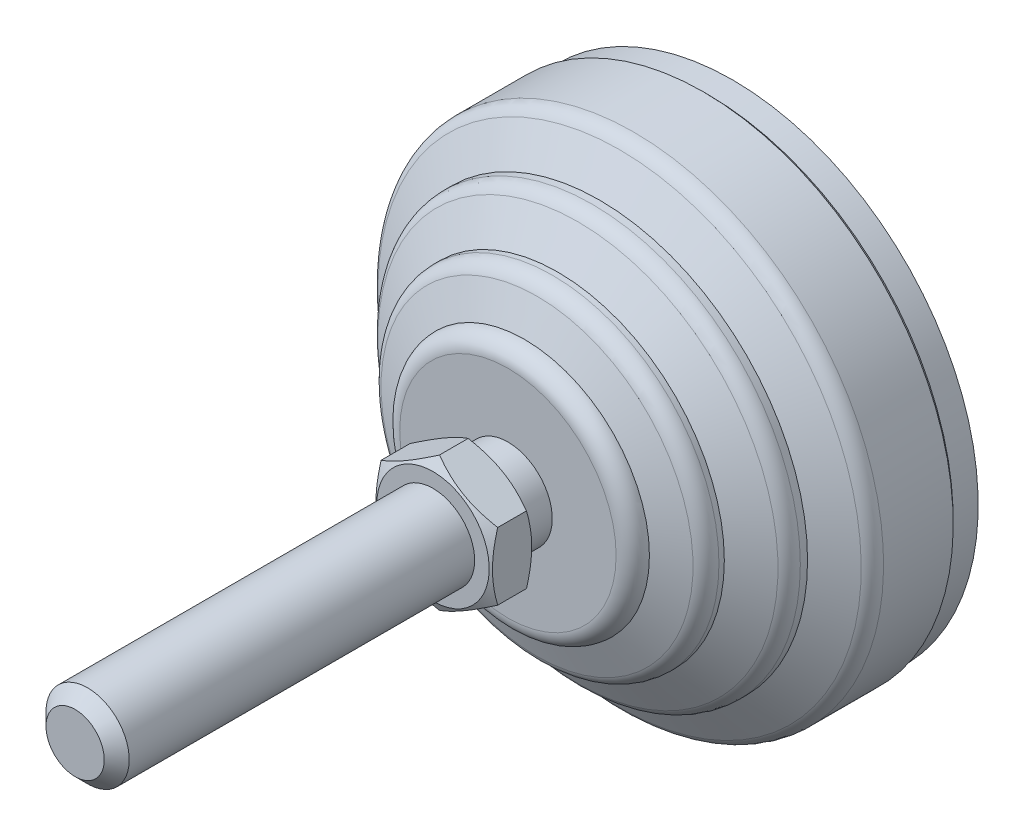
ISO-10303-21;
HEADER;
FILE_DESCRIPTION(('STEP AP214'),'2;1');
FILE_NAME('part.step','',(''),(''),'','','');
FILE_SCHEMA(('AUTOMOTIVE_DESIGN { 1 0 10303 214 1 1 1 1 }'));
ENDSEC;
DATA;
#1=APPLICATION_CONTEXT('core data for automotive mechanical design processes');
#2=APPLICATION_PROTOCOL_DEFINITION('international standard','automotive_design',2000,#1);
#3=PRODUCT_CONTEXT('',#1,'mechanical');
#4=PRODUCT('Part','Part','',(#3));
#5=PRODUCT_RELATED_PRODUCT_CATEGORY('part','',(#4));
#6=PRODUCT_DEFINITION_FORMATION('','',#4);
#7=PRODUCT_DEFINITION_CONTEXT('part definition',#1,'design');
#8=PRODUCT_DEFINITION('design','',#6,#7);
#9=PRODUCT_DEFINITION_SHAPE('','',#8);
#10=(LENGTH_UNIT() NAMED_UNIT(*) SI_UNIT(.MILLI.,.METRE.));
#11=(NAMED_UNIT(*) PLANE_ANGLE_UNIT() SI_UNIT($,.RADIAN.));
#12=(NAMED_UNIT(*) SI_UNIT($,.STERADIAN.) SOLID_ANGLE_UNIT());
#13=UNCERTAINTY_MEASURE_WITH_UNIT(LENGTH_MEASURE(1.E-05),#10,'distance_accuracy_value','');
#14=(GEOMETRIC_REPRESENTATION_CONTEXT(3) GLOBAL_UNCERTAINTY_ASSIGNED_CONTEXT((#13)) GLOBAL_UNIT_ASSIGNED_CONTEXT((#10,
#11,#12)) REPRESENTATION_CONTEXT('',''));
#15=CARTESIAN_POINT('',(0.,0.,0.));
#16=DIRECTION('',(0.,0.,1.));
#17=DIRECTION('',(1.,0.,0.));
#18=AXIS2_PLACEMENT_3D('',#15,#16,#17);
#19=CARTESIAN_POINT('',(-5.32445501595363,0.,31.));
#20=DIRECTION('',(0.,0.,1.));
#21=DIRECTION('',(0.,-1.,0.));
#22=AXIS2_PLACEMENT_3D('',#19,#20,#21);
#23=PLANE('',#22);
#24=CARTESIAN_POINT('',(0.,0.,31.));
#25=DIRECTION('',(0.,0.,-1.));
#26=DIRECTION('',(-1.,0.,0.));
#27=AXIS2_PLACEMENT_3D('',#24,#25,#26);
#28=CIRCLE('',#27,6.75);
#29=CARTESIAN_POINT('',(-6.75,0.,31.));
#30=VERTEX_POINT('',#29);
#31=EDGE_CURVE('E491',#30,#30,#28,.T.);
#32=ORIENTED_EDGE('',*,*,#31,.T.);
#33=EDGE_LOOP('',(#32));
#34=FACE_BOUND('',#33,.T.);
#35=CARTESIAN_POINT('',(0.,0.,31.));
#36=DIRECTION('',(0.,0.,-1.));
#37=DIRECTION('',(0.,1.,0.));
#38=AXIS2_PLACEMENT_3D('',#35,#36,#37);
#39=CIRCLE('',#38,5.32445501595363);
#40=CARTESIAN_POINT('',(0.,5.32445501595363,31.));
#41=VERTEX_POINT('',#40);
#42=EDGE_CURVE('E137',#41,#41,#39,.T.);
#43=ORIENTED_EDGE('',*,*,#42,.F.);
#44=EDGE_LOOP('',(#43));
#45=FACE_BOUND('',#44,.T.);
#46=ADVANCED_FACE('F14',(#34,#45),#23,.F.);
#47=CARTESIAN_POINT('',(0.,0.,0.));
#48=DIRECTION('',(0.,0.,-1.));
#49=DIRECTION('',(0.,1.,0.));
#50=AXIS2_PLACEMENT_3D('',#47,#48,#49);
#51=CYLINDRICAL_SURFACE('',#50,5.32445501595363);
#52=CARTESIAN_POINT('',(0.,0.,27.));
#53=DIRECTION('',(0.,0.,-1.));
#54=DIRECTION('',(0.,1.,0.));
#55=AXIS2_PLACEMENT_3D('',#52,#53,#54);
#56=CIRCLE('',#55,5.32445501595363);
#57=CARTESIAN_POINT('',(0.,5.32445501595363,27.));
#58=VERTEX_POINT('',#57);
#59=EDGE_CURVE('E134',#58,#58,#56,.T.);
#60=ORIENTED_EDGE('',*,*,#59,.F.);
#61=EDGE_LOOP('',(#60));
#62=FACE_BOUND('',#61,.T.);
#63=ORIENTED_EDGE('',*,*,#42,.T.);
#64=EDGE_LOOP('',(#63));
#65=FACE_BOUND('',#64,.T.);
#66=ADVANCED_FACE('F284',(#62,#65),#51,.T.);
#67=CARTESIAN_POINT('',(-13.,0.,27.));
#68=DIRECTION('',(0.,0.,-1.));
#69=DIRECTION('',(0.,1.,0.));
#70=AXIS2_PLACEMENT_3D('',#67,#68,#69);
#71=PLANE('',#70);
#72=CARTESIAN_POINT('',(0.,0.,27.));
#73=DIRECTION('',(0.,0.,-1.));
#74=DIRECTION('',(0.,1.,0.));
#75=AXIS2_PLACEMENT_3D('',#72,#73,#74);
#76=CIRCLE('',#75,13.);
#77=CARTESIAN_POINT('',(0.,13.,27.));
#78=VERTEX_POINT('',#77);
#79=EDGE_CURVE('E131',#78,#78,#76,.T.);
#80=ORIENTED_EDGE('',*,*,#79,.F.);
#81=EDGE_LOOP('',(#80));
#82=FACE_BOUND('',#81,.T.);
#83=ORIENTED_EDGE('',*,*,#59,.T.);
#84=EDGE_LOOP('',(#83));
#85=FACE_BOUND('',#84,.T.);
#86=ADVANCED_FACE('F280',(#82,#85),#71,.F.);
#87=CARTESIAN_POINT('',(0.,0.,25.));
#88=DIRECTION('',(0.,0.,-1.));
#89=DIRECTION('',(0.,1.,0.));
#90=AXIS2_PLACEMENT_3D('',#87,#88,#89);
#91=TOROIDAL_SURFACE('',#90,13.,2.);
#92=CARTESIAN_POINT('',(0.,0.,25.));
#93=DIRECTION('',(0.,0.,-1.));
#94=DIRECTION('',(0.,1.,0.));
#95=AXIS2_PLACEMENT_3D('',#92,#93,#94);
#96=CIRCLE('',#95,15.);
#97=CARTESIAN_POINT('',(0.,15.,25.));
#98=VERTEX_POINT('',#97);
#99=EDGE_CURVE('E128',#98,#98,#96,.T.);
#100=ORIENTED_EDGE('',*,*,#99,.F.);
#101=EDGE_LOOP('',(#100));
#102=FACE_BOUND('',#101,.T.);
#103=ORIENTED_EDGE('',*,*,#79,.T.);
#104=EDGE_LOOP('',(#103));
#105=FACE_BOUND('',#104,.T.);
#106=ADVANCED_FACE('F276',(#102,#105),#91,.T.);
#107=CARTESIAN_POINT('',(0.,0.,25.));
#108=DIRECTION('',(0.,0.,-1.));
#109=DIRECTION('',(0.,1.,0.));
#110=AXIS2_PLACEMENT_3D('',#107,#108,#109);
#111=CONICAL_SURFACE('',#110,15.,1.19028994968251);
#112=CARTESIAN_POINT('',(0.,0.,23.5028874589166));
#113=DIRECTION('',(0.,0.,-1.));
#114=DIRECTION('',(0.,1.,0.));
#115=AXIS2_PLACEMENT_3D('',#112,#113,#114);
#116=CIRCLE('',#115,18.7427813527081);
#117=CARTESIAN_POINT('',(0.,18.7427813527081,23.5028874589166));
#118=VERTEX_POINT('',#117);
#119=EDGE_CURVE('E125',#118,#118,#116,.T.);
#120=ORIENTED_EDGE('',*,*,#119,.F.);
#121=EDGE_LOOP('',(#120));
#122=FACE_BOUND('',#121,.T.);
#123=ORIENTED_EDGE('',*,*,#99,.T.);
#124=EDGE_LOOP('',(#123));
#125=FACE_BOUND('',#124,.T.);
#126=ADVANCED_FACE('F272',(#122,#125),#111,.T.);
#127=CARTESIAN_POINT('',(0.,0.,21.6459340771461));
#128=DIRECTION('',(0.,0.,-1.));
#129=DIRECTION('',(0.,1.,0.));
#130=AXIS2_PLACEMENT_3D('',#127,#128,#129);
#131=TOROIDAL_SURFACE('',#130,18.,2.);
#132=CARTESIAN_POINT('',(0.,0.,21.6459340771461));
#133=DIRECTION('',(0.,0.,-1.));
#134=DIRECTION('',(0.,1.,0.));
#135=AXIS2_PLACEMENT_3D('',#132,#133,#134);
#136=CIRCLE('',#135,20.);
#137=CARTESIAN_POINT('',(0.,20.,21.6459340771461));
#138=VERTEX_POINT('',#137);
#139=EDGE_CURVE('E122',#138,#138,#136,.T.);
#140=ORIENTED_EDGE('',*,*,#139,.F.);
#141=EDGE_LOOP('',(#140));
#142=FACE_BOUND('',#141,.T.);
#143=ORIENTED_EDGE('',*,*,#119,.T.);
#144=EDGE_LOOP('',(#143));
#145=FACE_BOUND('',#144,.T.);
#146=ADVANCED_FACE('F268',(#142,#145),#131,.T.);
#147=CARTESIAN_POINT('',(0.,0.,0.));
#148=DIRECTION('',(0.,0.,-1.));
#149=DIRECTION('',(0.,1.,0.));
#150=AXIS2_PLACEMENT_3D('',#147,#148,#149);
#151=CYLINDRICAL_SURFACE('',#150,20.);
#152=CARTESIAN_POINT('',(0.,0.,21.));
#153=DIRECTION('',(0.,0.,-1.));
#154=DIRECTION('',(0.,1.,0.));
#155=AXIS2_PLACEMENT_3D('',#152,#153,#154);
#156=CIRCLE('',#155,20.);
#157=CARTESIAN_POINT('',(0.,20.,21.));
#158=VERTEX_POINT('',#157);
#159=EDGE_CURVE('E119',#158,#158,#156,.T.);
#160=ORIENTED_EDGE('',*,*,#159,.F.);
#161=EDGE_LOOP('',(#160));
#162=FACE_BOUND('',#161,.T.);
#163=ORIENTED_EDGE('',*,*,#139,.T.);
#164=EDGE_LOOP('',(#163));
#165=FACE_BOUND('',#164,.T.);
#166=ADVANCED_FACE('F264',(#162,#165),#151,.T.);
#167=CARTESIAN_POINT('',(0.,0.,21.));
#168=DIRECTION('',(0.,0.,-1.));
#169=DIRECTION('',(0.,1.,0.));
#170=AXIS2_PLACEMENT_3D('',#167,#168,#169);
#171=CONICAL_SURFACE('',#170,20.,1.03037682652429);
#172=CARTESIAN_POINT('',(0.,0.,18.5826050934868));
#173=DIRECTION('',(0.,0.,-1.));
#174=DIRECTION('',(0.,1.,0.));
#175=AXIS2_PLACEMENT_3D('',#172,#173,#174);
#176=CIRCLE('',#175,24.0289915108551);
#177=CARTESIAN_POINT('',(0.,24.0289915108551,18.5826050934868));
#178=VERTEX_POINT('',#177);
#179=EDGE_CURVE('E116',#178,#178,#176,.T.);
#180=ORIENTED_EDGE('',*,*,#179,.F.);
#181=EDGE_LOOP('',(#180));
#182=FACE_BOUND('',#181,.T.);
#183=ORIENTED_EDGE('',*,*,#159,.T.);
#184=EDGE_LOOP('',(#183));
#185=FACE_BOUND('',#184,.T.);
#186=ADVANCED_FACE('F260',(#182,#185),#171,.T.);
#187=CARTESIAN_POINT('',(0.,0.,16.8676192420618));
#188=DIRECTION('',(0.,0.,-1.));
#189=DIRECTION('',(0.,1.,0.));
#190=AXIS2_PLACEMENT_3D('',#187,#188,#189);
#191=TOROIDAL_SURFACE('',#190,23.,1.99999999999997);
#192=CARTESIAN_POINT('',(0.,0.,16.8676192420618));
#193=DIRECTION('',(0.,0.,-1.));
#194=DIRECTION('',(0.,1.,0.));
#195=AXIS2_PLACEMENT_3D('',#192,#193,#194);
#196=CIRCLE('',#195,25.);
#197=CARTESIAN_POINT('',(0.,25.,16.8676192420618));
#198=VERTEX_POINT('',#197);
#199=EDGE_CURVE('E113',#198,#198,#196,.T.);
#200=ORIENTED_EDGE('',*,*,#199,.F.);
#201=EDGE_LOOP('',(#200));
#202=FACE_BOUND('',#201,.T.);
#203=ORIENTED_EDGE('',*,*,#179,.T.);
#204=EDGE_LOOP('',(#203));
#205=FACE_BOUND('',#204,.T.);
#206=ADVANCED_FACE('F256',(#202,#205),#191,.T.);
#207=CARTESIAN_POINT('',(0.,0.,0.));
#208=DIRECTION('',(0.,0.,-1.));
#209=DIRECTION('',(0.,1.,0.));
#210=AXIS2_PLACEMENT_3D('',#207,#208,#209);
#211=CYLINDRICAL_SURFACE('',#210,25.);
#212=CARTESIAN_POINT('',(0.,0.,16.));
#213=DIRECTION('',(0.,0.,-1.));
#214=DIRECTION('',(0.,1.,0.));
#215=AXIS2_PLACEMENT_3D('',#212,#213,#214);
#216=CIRCLE('',#215,25.);
#217=CARTESIAN_POINT('',(0.,25.,16.));
#218=VERTEX_POINT('',#217);
#219=EDGE_CURVE('E110',#218,#218,#216,.T.);
#220=ORIENTED_EDGE('',*,*,#219,.F.);
#221=EDGE_LOOP('',(#220));
#222=FACE_BOUND('',#221,.T.);
#223=ORIENTED_EDGE('',*,*,#199,.T.);
#224=EDGE_LOOP('',(#223));
#225=FACE_BOUND('',#224,.T.);
#226=ADVANCED_FACE('F252',(#222,#225),#211,.T.);
#227=CARTESIAN_POINT('',(0.,0.,16.));
#228=DIRECTION('',(0.,0.,-1.));
#229=DIRECTION('',(0.,1.,0.));
#230=AXIS2_PLACEMENT_3D('',#227,#228,#229);
#231=CONICAL_SURFACE('',#230,25.,1.0303768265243);
#232=CARTESIAN_POINT('',(0.,0.,13.5826050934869));
#233=DIRECTION('',(0.,0.,-1.));
#234=DIRECTION('',(0.,1.,0.));
#235=AXIS2_PLACEMENT_3D('',#232,#233,#234);
#236=CIRCLE('',#235,29.0289915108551);
#237=CARTESIAN_POINT('',(0.,29.0289915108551,13.5826050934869));
#238=VERTEX_POINT('',#237);
#239=EDGE_CURVE('E107',#238,#238,#236,.T.);
#240=ORIENTED_EDGE('',*,*,#239,.F.);
#241=EDGE_LOOP('',(#240));
#242=FACE_BOUND('',#241,.T.);
#243=ORIENTED_EDGE('',*,*,#219,.T.);
#244=EDGE_LOOP('',(#243));
#245=FACE_BOUND('',#244,.T.);
#246=ADVANCED_FACE('F248',(#242,#245),#231,.T.);
#247=CARTESIAN_POINT('',(0.,0.,11.8676192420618));
#248=DIRECTION('',(0.,0.,-1.));
#249=DIRECTION('',(0.,1.,0.));
#250=AXIS2_PLACEMENT_3D('',#247,#248,#249);
#251=TOROIDAL_SURFACE('',#250,28.,1.99999999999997);
#252=CARTESIAN_POINT('',(0.,0.,11.8676192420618));
#253=DIRECTION('',(0.,0.,-1.));
#254=DIRECTION('',(0.,1.,0.));
#255=AXIS2_PLACEMENT_3D('',#252,#253,#254);
#256=CIRCLE('',#255,30.);
#257=CARTESIAN_POINT('',(0.,30.,11.8676192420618));
#258=VERTEX_POINT('',#257);
#259=EDGE_CURVE('E104',#258,#258,#256,.T.);
#260=ORIENTED_EDGE('',*,*,#259,.F.);
#261=EDGE_LOOP('',(#260));
#262=FACE_BOUND('',#261,.T.);
#263=ORIENTED_EDGE('',*,*,#239,.T.);
#264=EDGE_LOOP('',(#263));
#265=FACE_BOUND('',#264,.T.);
#266=ADVANCED_FACE('F244',(#262,#265),#251,.T.);
#267=CARTESIAN_POINT('',(0.,0.,0.));
#268=DIRECTION('',(0.,0.,-1.));
#269=DIRECTION('',(0.,1.,0.));
#270=AXIS2_PLACEMENT_3D('',#267,#268,#269);
#271=CYLINDRICAL_SURFACE('',#270,30.);
#272=CARTESIAN_POINT('',(0.,0.,3.5));
#273=DIRECTION('',(0.,0.,-1.));
#274=DIRECTION('',(0.,1.,0.));
#275=AXIS2_PLACEMENT_3D('',#272,#273,#274);
#276=CIRCLE('',#275,30.);
#277=CARTESIAN_POINT('',(0.,30.,3.5));
#278=VERTEX_POINT('',#277);
#279=EDGE_CURVE('E101',#278,#278,#276,.T.);
#280=ORIENTED_EDGE('',*,*,#279,.F.);
#281=EDGE_LOOP('',(#280));
#282=FACE_BOUND('',#281,.T.);
#283=ORIENTED_EDGE('',*,*,#259,.T.);
#284=EDGE_LOOP('',(#283));
#285=FACE_BOUND('',#284,.T.);
#286=ADVANCED_FACE('F240',(#282,#285),#271,.T.);
#287=CARTESIAN_POINT('',(0.,0.,3.5));
#288=DIRECTION('',(0.,0.,1.));
#289=DIRECTION('',(0.,-1.,0.));
#290=AXIS2_PLACEMENT_3D('',#287,#288,#289);
#291=CONICAL_SURFACE('',#290,30.,0.785398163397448);
#292=CARTESIAN_POINT('',(0.,0.,3.));
#293=DIRECTION('',(0.,0.,-1.));
#294=DIRECTION('',(0.,1.,0.));
#295=AXIS2_PLACEMENT_3D('',#292,#293,#294);
#296=CIRCLE('',#295,29.5);
#297=CARTESIAN_POINT('',(0.,29.5,3.));
#298=VERTEX_POINT('',#297);
#299=EDGE_CURVE('E98',#298,#298,#296,.T.);
#300=ORIENTED_EDGE('',*,*,#299,.F.);
#301=EDGE_LOOP('',(#300));
#302=FACE_BOUND('',#301,.T.);
#303=ORIENTED_EDGE('',*,*,#279,.T.);
#304=EDGE_LOOP('',(#303));
#305=FACE_BOUND('',#304,.T.);
#306=ADVANCED_FACE('F236',(#302,#305),#291,.T.);
#307=CARTESIAN_POINT('',(0.,0.,0.));
#308=DIRECTION('',(0.,0.,-1.));
#309=DIRECTION('',(0.,1.,0.));
#310=AXIS2_PLACEMENT_3D('',#307,#308,#309);
#311=CYLINDRICAL_SURFACE('',#310,29.5);
#312=CARTESIAN_POINT('',(0.,0.,0.));
#313=DIRECTION('',(0.,0.,-1.));
#314=DIRECTION('',(0.,1.,0.));
#315=AXIS2_PLACEMENT_3D('',#312,#313,#314);
#316=CIRCLE('',#315,29.5);
#317=CARTESIAN_POINT('',(0.,29.5,0.));
#318=VERTEX_POINT('',#317);
#319=EDGE_CURVE('E95',#318,#318,#316,.T.);
#320=ORIENTED_EDGE('',*,*,#319,.F.);
#321=EDGE_LOOP('',(#320));
#322=FACE_BOUND('',#321,.T.);
#323=ORIENTED_EDGE('',*,*,#299,.T.);
#324=EDGE_LOOP('',(#323));
#325=FACE_BOUND('',#324,.T.);
#326=ADVANCED_FACE('F232',(#322,#325),#311,.T.);
#327=CARTESIAN_POINT('',(-29.5,0.,0.));
#328=DIRECTION('',(0.,0.,1.));
#329=DIRECTION('',(0.,-1.,0.));
#330=AXIS2_PLACEMENT_3D('',#327,#328,#329);
#331=PLANE('',#330);
#332=ORIENTED_EDGE('',*,*,#319,.T.);
#333=EDGE_LOOP('',(#332));
#334=FACE_BOUND('',#333,.T.);
#335=ADVANCED_FACE('F228',(#334),#331,.F.);
#336=CARTESIAN_POINT('',(0.,0.,32.4809654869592));
#337=DIRECTION('',(0.,0.,1.));
#338=DIRECTION('',(1.,0.,0.));
#339=AXIS2_PLACEMENT_3D('',#336,#337,#338);
#340=CONICAL_SURFACE('',#339,9.3151074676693,1.0471975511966);
#341=CARTESIAN_POINT('',(0.256818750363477,-8.23117814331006,31.8574711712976));
#342=CARTESIAN_POINT('',(-0.0698173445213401,-8.04259470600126,31.7427512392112));
#343=CARTESIAN_POINT('',(-0.39950819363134,-7.85224760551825,31.6377556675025));
#344=CARTESIAN_POINT('',(-1.06526860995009,-7.46787064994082,31.4534268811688));
#345=CARTESIAN_POINT('',(-1.40135504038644,-7.27383105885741,31.3741757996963));
#346=CARTESIAN_POINT('',(-1.90406587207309,-6.98359082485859,31.280713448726));
#347=CARTESIAN_POINT('',(-2.06894273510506,-6.88839912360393,31.2540149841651));
#348=CARTESIAN_POINT('',(-2.39955942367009,-6.69751748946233,31.2089682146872));
#349=CARTESIAN_POINT('',(-2.56529925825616,-6.60182755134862,31.1906199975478));
#350=CARTESIAN_POINT('',(-2.89707209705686,-6.41027841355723,31.162797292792));
#351=CARTESIAN_POINT('',(-3.06310419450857,-6.31441973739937,31.1533085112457));
#352=CARTESIAN_POINT('',(-3.39537235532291,-6.12258462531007,31.1434248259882));
#353=CARTESIAN_POINT('',(-3.56160841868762,-6.02660818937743,31.1430299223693));
#354=CARTESIAN_POINT('',(-3.90429503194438,-5.82875798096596,31.1516078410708));
#355=CARTESIAN_POINT('',(-4.08073466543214,-5.72689051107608,31.1611676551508));
#356=CARTESIAN_POINT('',(-4.43299469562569,-5.52351308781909,31.1902604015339));
#357=CARTESIAN_POINT('',(-4.60881507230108,-5.42200314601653,31.2097936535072));
#358=CARTESIAN_POINT('',(-4.95980532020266,-5.21935883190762,31.2582832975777));
#359=CARTESIAN_POINT('',(-5.13497334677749,-5.11822552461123,31.287257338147));
#360=CARTESIAN_POINT('',(-5.48407953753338,-4.91666897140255,31.3538245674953));
#361=CARTESIAN_POINT('',(-5.6580176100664,-4.81624577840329,31.3914183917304));
#362=CARTESIAN_POINT('',(-6.01003100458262,-4.61301075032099,31.4756500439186));
#363=CARTESIAN_POINT('',(-6.18806108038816,-4.51022503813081,31.5225383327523));
#364=CARTESIAN_POINT('',(-6.54258825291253,-4.30553867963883,31.6235373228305));
#365=CARTESIAN_POINT('',(-6.71908518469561,-4.20363812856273,31.6776487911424));
#366=CARTESIAN_POINT('',(-7.06981263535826,-4.00114554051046,31.791890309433));
#367=CARTESIAN_POINT('',(-7.2440495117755,-3.9005498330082,31.8519945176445));
#368=CARTESIAN_POINT('',(-7.59100481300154,-3.70023509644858,31.9775454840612));
#369=CARTESIAN_POINT('',(-7.76372378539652,-3.60051575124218,32.0429902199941));
#370=CARTESIAN_POINT('',(-7.93575334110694,-3.5011944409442,32.1106977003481));
#371=B_SPLINE_CURVE_WITH_KNOTS('',3,(#341,#342,#343,#344,#345,#346,#347,#348,#349,#350,#351,
#352,#353,#354,#355,#356,#357,#358,#359,#360,#361,#362,#363,#364,#365,#366,#367,#368,#369,#370),
.UNSPECIFIED.,.F.,.F.,(4,2,2,2,2,2,2,2,2,2,2,2,2,2,4),(0.,1.18342782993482,2.37059491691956,
2.94716499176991,3.52374112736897,4.09938539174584,4.67502966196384,5.28664963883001,
5.89828922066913,6.51107881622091,7.12391360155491,7.75631746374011,8.38878853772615,
9.01864143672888,9.64825692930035),.UNSPECIFIED.);
#372=CARTESIAN_POINT('',(0.,-8.08290376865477,31.7695523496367));
#373=VERTEX_POINT('',#372);
#374=CARTESIAN_POINT('',(-7.,-4.04145188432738,31.7695523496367));
#375=VERTEX_POINT('',#374);
#376=EDGE_CURVE('E73',#373,#375,#371,.T.);
#377=ORIENTED_EDGE('',*,*,#376,.T.);
#378=CARTESIAN_POINT('',(-7.,-10.7973806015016,34.5321841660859));
#379=CARTESIAN_POINT('',(-7.,-10.4921283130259,34.3843454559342));
#380=CARTESIAN_POINT('',(-7.,-10.1861689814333,34.2379413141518));
#381=CARTESIAN_POINT('',(-7.,-9.57245998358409,33.9488102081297));
#382=CARTESIAN_POINT('',(-7.,-9.2647100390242,33.8060838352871));
#383=CARTESIAN_POINT('',(-7.,-8.64542972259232,33.5243857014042));
#384=CARTESIAN_POINT('',(-7.,-8.33388785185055,33.3854391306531));
#385=CARTESIAN_POINT('',(-7.,-7.70830568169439,33.1133109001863));
#386=CARTESIAN_POINT('',(-7.,-7.39426550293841,32.9801289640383));
#387=CARTESIAN_POINT('',(-7.,-6.75328183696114,32.7169876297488));
#388=CARTESIAN_POINT('',(-7.,-6.42624255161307,32.5872602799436));
#389=CARTESIAN_POINT('',(-7.,-5.76831711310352,32.3377661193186));
#390=CARTESIAN_POINT('',(-7.,-5.43743052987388,32.2180004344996));
#391=CARTESIAN_POINT('',(-7.,-4.77191852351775,31.9916169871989));
#392=CARTESIAN_POINT('',(-7.,-4.43730242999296,31.8849720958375));
#393=CARTESIAN_POINT('',(-7.,-3.76328319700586,31.6882892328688));
#394=CARTESIAN_POINT('',(-7.,-3.42388162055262,31.5982459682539));
#395=CARTESIAN_POINT('',(-7.,-2.74191254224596,31.4396072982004));
#396=CARTESIAN_POINT('',(-7.,-2.39937229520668,31.3708979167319));
#397=CARTESIAN_POINT('',(-7.,-1.88248997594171,31.2868383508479));
#398=CARTESIAN_POINT('',(-7.,-1.70967073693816,31.2619847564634));
#399=CARTESIAN_POINT('',(-7.,-1.36319329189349,31.2191011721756));
#400=CARTESIAN_POINT('',(-7.,-1.18953516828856,31.2010705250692));
#401=CARTESIAN_POINT('',(-7.,-0.843855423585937,31.1724151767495));
#402=CARTESIAN_POINT('',(-7.,-0.671841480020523,31.1616982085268));
#403=CARTESIAN_POINT('',(-7.,-0.327514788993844,31.1475438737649));
#404=CARTESIAN_POINT('',(-7.,-0.155202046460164,31.144106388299));
#405=CARTESIAN_POINT('',(-7.,0.189414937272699,31.1445928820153));
#406=CARTESIAN_POINT('',(-7.,0.361719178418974,31.148516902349));
#407=CARTESIAN_POINT('',(-7.,0.706010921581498,31.1636315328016));
#408=CARTESIAN_POINT('',(-7.,0.877998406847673,31.1748225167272));
#409=CARTESIAN_POINT('',(-7.,1.29312527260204,31.2103697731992));
#410=CARTESIAN_POINT('',(-7.,1.53596713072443,31.2382732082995));
#411=CARTESIAN_POINT('',(-7.,2.01979840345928,31.3070318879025));
#412=CARTESIAN_POINT('',(-7.,2.26078755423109,31.3478889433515));
#413=CARTESIAN_POINT('',(-7.,2.9807285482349,31.4877197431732));
#414=CARTESIAN_POINT('',(-7.,3.45637486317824,31.6039261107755));
#415=CARTESIAN_POINT('',(-7.,4.16751783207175,31.8048067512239));
#416=CARTESIAN_POINT('',(-7.,4.40671887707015,31.8771158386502));
#417=CARTESIAN_POINT('',(-7.,4.88279663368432,32.0290867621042));
#418=CARTESIAN_POINT('',(-7.,5.119673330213,32.1087486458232));
#419=CARTESIAN_POINT('',(-7.,5.59117997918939,32.2741601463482));
#420=CARTESIAN_POINT('',(-7.,5.82581067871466,32.3599076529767));
#421=CARTESIAN_POINT('',(-7.,6.29313874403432,32.5364972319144));
#422=CARTESIAN_POINT('',(-7.,6.5258361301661,32.627339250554));
#423=CARTESIAN_POINT('',(-7.,7.065389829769,32.8436945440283));
#424=CARTESIAN_POINT('',(-7.,7.37159599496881,32.97082595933));
#425=CARTESIAN_POINT('',(-7.,7.98148681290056,33.2310163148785));
#426=CARTESIAN_POINT('',(-7.,8.28517132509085,33.3640755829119));
#427=CARTESIAN_POINT('',(-7.,8.89047023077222,33.6349578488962));
#428=CARTESIAN_POINT('',(-7.,9.19208423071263,33.7727817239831));
#429=CARTESIAN_POINT('',(-7.,9.79353456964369,34.052261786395));
#430=CARTESIAN_POINT('',(-7.,10.0933708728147,34.1939180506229));
#431=CARTESIAN_POINT('',(-7.,10.6918445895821,34.4804996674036));
#432=CARTESIAN_POINT('',(-7.,10.9904804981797,34.6254281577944));
#433=CARTESIAN_POINT('',(-7.,11.5864843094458,34.9178716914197));
#434=CARTESIAN_POINT('',(-7.,11.8838522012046,35.0653867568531));
#435=CARTESIAN_POINT('',(-7.,12.7742777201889,35.5111012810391));
#436=CARTESIAN_POINT('',(-7.,13.3657309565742,35.8125056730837));
#437=CARTESIAN_POINT('',(-7.,14.4976391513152,36.39666231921));
#438=CARTESIAN_POINT('',(-7.,15.0383381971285,36.6789436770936));
#439=CARTESIAN_POINT('',(-7.,16.1177198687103,37.2473749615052));
#440=CARTESIAN_POINT('',(-7.,16.6564024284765,37.533525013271));
#441=CARTESIAN_POINT('',(-7.,17.7309206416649,38.1081040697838));
#442=CARTESIAN_POINT('',(-7.,18.2667600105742,38.3965261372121));
#443=CARTESIAN_POINT('',(-7.,19.3371437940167,38.9756978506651));
#444=CARTESIAN_POINT('',(-7.,19.8716882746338,39.2664473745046));
#445=CARTESIAN_POINT('',(-7.,20.4057533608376,39.5580689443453));
#446=B_SPLINE_CURVE_WITH_KNOTS('',3,(#378,#379,#380,#381,#382,#383,#384,#385,#386,#387,#388,
#389,#390,#391,#392,#393,#394,#395,#396,#397,#398,#399,#400,#401,#402,#403,#404,#405,#406,#407,
#408,#409,#410,#411,#412,#413,#414,#415,#416,#417,#418,#419,#420,#421,#422,#423,#424,#425,#426,
#427,#428,#429,#430,#431,#432,#433,#434,#435,#436,#437,#438,#439,#440,#441,#442,#443,#444,#445),
.UNSPECIFIED.,.F.,.F.,(4,2,2,2,2,2,2,2,2,2,2,2,2,2,2,2,2,2,2,2,2,2,2,2,2,2,2,2,2,2,2,2,2,4),(0.,
1.01751808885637,2.03519878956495,3.05851920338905,4.08179049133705,5.1371526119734,
6.19263386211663,7.24589472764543,8.29881920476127,9.34601760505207,9.86969575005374,
10.3933234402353,10.9102166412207,11.4271013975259,11.9439890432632,12.4609032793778,
13.1938070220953,13.9268132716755,15.3936631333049,16.1432770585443,16.8928958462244,
17.6422559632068,18.3916081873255,19.3861715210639,20.3807899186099,21.3755924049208,
22.3704148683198,23.3662356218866,24.3620649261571,26.3534778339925,28.1833091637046,
30.0131998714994,31.8387895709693,33.6642840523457),.UNSPECIFIED.);
#447=CARTESIAN_POINT('',(-7.,4.04145188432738,31.7695523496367));
#448=VERTEX_POINT('',#447);
#449=EDGE_CURVE('E81',#375,#448,#446,.T.);
#450=ORIENTED_EDGE('',*,*,#449,.T.);
#451=CARTESIAN_POINT('',(-12.6790376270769,0.762657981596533,34.4363624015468));
#452=CARTESIAN_POINT('',(-12.4105315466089,0.917680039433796,34.2870401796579));
#453=CARTESIAN_POINT('',(-12.1413715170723,1.07307965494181,34.1392558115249));
#454=CARTESIAN_POINT('',(-11.601382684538,1.38484235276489,33.8476591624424));
#455=CARTESIAN_POINT('',(-11.3305535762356,1.54120561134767,33.7038476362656));
#456=CARTESIAN_POINT('',(-10.7852497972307,1.85603689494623,33.4202571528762));
#457=CARTESIAN_POINT('',(-10.510762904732,2.01451197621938,33.280509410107));
#458=CARTESIAN_POINT('',(-9.9594520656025,2.33281143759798,33.0073274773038));
#459=CARTESIAN_POINT('',(-9.68262825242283,2.49263574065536,32.873892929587));
#460=CARTESIAN_POINT('',(-9.12363602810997,2.8153700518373,32.6138773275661));
#461=CARTESIAN_POINT('',(-8.84144191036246,2.97829490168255,32.4873695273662));
#462=CARTESIAN_POINT('',(-8.27362168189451,3.30612606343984,32.2448660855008));
#463=CARTESIAN_POINT('',(-7.98799516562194,3.4710326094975,32.1288717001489));
#464=CARTESIAN_POINT('',(-7.41351709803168,3.80270767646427,31.9107506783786));
#465=CARTESIAN_POINT('',(-7.12467499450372,3.96947074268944,31.8085912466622));
#466=CARTESIAN_POINT('',(-6.54284935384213,4.30538793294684,31.6216856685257));
#467=CARTESIAN_POINT('',(-6.24986728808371,4.47454120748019,31.5369334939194));
#468=CARTESIAN_POINT('',(-5.66397144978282,4.81280832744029,31.3903512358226));
#469=CARTESIAN_POINT('',(-5.37111848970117,4.98188706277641,31.3282061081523));
#470=CARTESIAN_POINT('',(-4.92944057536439,5.23688992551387,31.2540803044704));
#471=CARTESIAN_POINT('',(-4.78179532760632,5.32213294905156,31.2325521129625));
#472=CARTESIAN_POINT('',(-4.48588524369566,5.4929767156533,31.1962864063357));
#473=CARTESIAN_POINT('',(-4.33762046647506,5.57857742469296,31.1815482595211));
#474=CARTESIAN_POINT('',(-4.0415116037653,5.74953595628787,31.1592503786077));
#475=CARTESIAN_POINT('',(-3.89366975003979,5.83489249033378,31.15165126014));
#476=CARTESIAN_POINT('',(-3.59784091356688,6.00568934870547,31.1436629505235));
#477=CARTESIAN_POINT('',(-3.44985393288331,6.09112967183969,31.1432736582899));
#478=CARTESIAN_POINT('',(-3.15403491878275,6.26192085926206,31.1497140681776));
#479=CARTESIAN_POINT('',(-3.00620285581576,6.34727174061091,31.1565419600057));
#480=CARTESIAN_POINT('',(-2.71090769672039,6.51776048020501,31.1772551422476));
#481=CARTESIAN_POINT('',(-2.56344462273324,6.60289832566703,31.1911408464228));
#482=CARTESIAN_POINT('',(-2.19939738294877,6.81308109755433,31.2338544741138));
#483=CARTESIAN_POINT('',(-1.98315571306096,6.93792828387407,31.2666445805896));
#484=CARTESIAN_POINT('',(-1.55250623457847,7.18656387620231,31.3455168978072));
#485=CARTESIAN_POINT('',(-1.33809873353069,7.31035210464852,31.3916012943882));
#486=CARTESIAN_POINT('',(-0.697182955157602,7.6803850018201,31.5474649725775));
#487=CARTESIAN_POINT('',(-0.273836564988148,7.92480415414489,31.6747421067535));
#488=CARTESIAN_POINT('',(0.359051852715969,8.29020245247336,31.8921639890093));
#489=CARTESIAN_POINT('',(0.571939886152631,8.41311341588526,31.9700434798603));
#490=CARTESIAN_POINT('',(0.995660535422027,8.65774864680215,32.1330625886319));
#491=CARTESIAN_POINT('',(1.20649297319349,8.77947281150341,32.2182028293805));
#492=CARTESIAN_POINT('',(1.6250446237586,9.02112371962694,32.3939582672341));
#493=CARTESIAN_POINT('',(1.83277477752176,9.1410567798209,32.4845390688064));
#494=CARTESIAN_POINT('',(2.24650063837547,9.3799215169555,32.6706177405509));
#495=CARTESIAN_POINT('',(2.45249689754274,9.49885351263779,32.7661139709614));
#496=CARTESIAN_POINT('',(2.65776837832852,9.61736705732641,32.8635998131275));
#497=B_SPLINE_CURVE_WITH_KNOTS('',3,(#451,#452,#453,#454,#455,#456,#457,#458,#459,#460,#461,
#462,#463,#464,#465,#466,#467,#468,#469,#470,#471,#472,#473,#474,#475,#476,#477,#478,#479,#480,
#481,#482,#483,#484,#485,#486,#487,#488,#489,#490,#491,#492,#493,#494,#495,#496),.UNSPECIFIED.,
.F.,.F.,(4,2,2,2,2,2,2,2,2,2,2,2,2,2,2,2,2,2,2,2,2,2,4),(0.,1.03240096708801,2.06499674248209,
3.10411577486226,4.14317586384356,5.19167321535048,6.24029569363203,7.28638723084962,
8.3321158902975,9.36265628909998,9.87806176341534,10.393419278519,10.905916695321,
11.418406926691,11.9307686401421,12.4431603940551,13.1982406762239,13.9534451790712,
15.4668227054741,16.2403603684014,17.0139644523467,17.783108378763,18.5519973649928),.UNSPECIFIED.);
#498=CARTESIAN_POINT('',(0.,8.08290376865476,31.7695523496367));
#499=VERTEX_POINT('',#498);
#500=EDGE_CURVE('E215',#448,#499,#497,.T.);
#501=ORIENTED_EDGE('',*,*,#500,.T.);
#502=CARTESIAN_POINT('',(-0.94227991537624,8.62692933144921,32.1132682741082));
#503=CARTESIAN_POINT('',(-0.770157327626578,8.52755430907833,32.0454593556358));
#504=CARTESIAN_POINT('',(-0.597345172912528,8.42778116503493,31.9799115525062));
#505=CARTESIAN_POINT('',(-0.250202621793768,8.22735831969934,31.8541516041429));
#506=CARTESIAN_POINT('',(-0.0758716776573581,8.1267083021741,31.7939414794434));
#507=CARTESIAN_POINT('',(0.275047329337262,7.924105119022,31.6794847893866));
#508=CARTESIAN_POINT('',(0.451641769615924,7.82214827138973,31.6252641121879));
#509=CARTESIAN_POINT('',(0.806366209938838,7.61734802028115,31.524045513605));
#510=CARTESIAN_POINT('',(0.984496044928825,7.51450471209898,31.4770468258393));
#511=CARTESIAN_POINT('',(1.3367057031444,7.31115637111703,31.3925991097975));
#512=CARTESIAN_POINT('',(1.51074016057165,7.21067753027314,31.354899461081));
#513=CARTESIAN_POINT('',(1.8600426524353,7.00900764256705,31.288123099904));
#514=CARTESIAN_POINT('',(2.0353105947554,6.90781664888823,31.2590457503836));
#515=CARTESIAN_POINT('',(2.38650413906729,6.7050549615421,31.2103551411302));
#516=CARTESIAN_POINT('',(2.56242788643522,6.60348533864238,31.1907242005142));
#517=CARTESIAN_POINT('',(2.91489878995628,6.39998616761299,31.1614447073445));
#518=CARTESIAN_POINT('',(3.09144592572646,6.29805663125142,31.1517958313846));
#519=CARTESIAN_POINT('',(3.43416151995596,6.10018969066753,31.1430611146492));
#520=CARTESIAN_POINT('',(3.60031866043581,6.00425882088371,31.1433775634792));
#521=CARTESIAN_POINT('',(3.93243242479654,5.81251284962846,31.1530969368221));
#522=CARTESIAN_POINT('',(4.09838904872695,5.71669774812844,31.1624998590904));
#523=CARTESIAN_POINT('',(4.43001392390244,5.52523403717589,31.1901459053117));
#524=CARTESIAN_POINT('',(4.59568127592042,5.42958594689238,31.2084032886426));
#525=CARTESIAN_POINT('',(4.92615638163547,5.23878605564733,31.2532660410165));
#526=CARTESIAN_POINT('',(5.09096414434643,5.14363424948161,31.2798713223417));
#527=CARTESIAN_POINT('',(5.5934603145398,4.85351795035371,31.3730473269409));
#528=CARTESIAN_POINT('',(5.92940596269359,4.65955963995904,31.4521046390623));
#529=CARTESIAN_POINT('',(6.59489559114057,4.27533902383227,31.6360565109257));
#530=CARTESIAN_POINT('',(6.92445635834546,4.08506702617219,31.7408691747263));
#531=CARTESIAN_POINT('',(7.25096302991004,3.89655831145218,31.8554159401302));
#532=B_SPLINE_CURVE_WITH_KNOTS('',3,(#502,#503,#504,#505,#506,#507,#508,#509,#510,#511,#512,
#513,#514,#515,#516,#517,#518,#519,#520,#521,#522,#523,#524,#525,#526,#527,#528,#529,#530,#531),
.UNSPECIFIED.,.F.,.F.,(4,2,2,2,2,2,2,2,2,2,2,2,2,2,4),(0.,0.630018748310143,1.26027497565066,
1.89315675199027,2.52597132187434,3.139192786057,3.75236893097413,4.36439288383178,
4.97639700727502,5.5517677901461,6.12713843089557,6.70343875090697,7.27973301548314,
8.46630520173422,9.64915211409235),.UNSPECIFIED.);
#533=CARTESIAN_POINT('',(7.,4.04145188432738,31.7695523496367));
#534=VERTEX_POINT('',#533);
#535=EDGE_CURVE('E481',#499,#534,#532,.T.);
#536=ORIENTED_EDGE('',*,*,#535,.T.);
#537=CARTESIAN_POINT('',(7.,-10.7973806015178,34.5321841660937));
#538=CARTESIAN_POINT('',(7.,-10.4921283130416,34.3843454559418));
#539=CARTESIAN_POINT('',(7.,-10.1861689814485,34.237941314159));
#540=CARTESIAN_POINT('',(7.,-9.57245998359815,33.9488102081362));
#541=CARTESIAN_POINT('',(7.,-9.26471003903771,33.8060838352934));
#542=CARTESIAN_POINT('',(7.,-8.64542972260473,33.5243857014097));
#543=CARTESIAN_POINT('',(7.,-8.3338878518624,33.3854391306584));
#544=CARTESIAN_POINT('',(7.,-7.70830568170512,33.1133109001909));
#545=CARTESIAN_POINT('',(7.,-7.39426550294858,32.9801289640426));
#546=CARTESIAN_POINT('',(7.,-6.75328183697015,32.7169876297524));
#547=CARTESIAN_POINT('',(7.,-6.42624255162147,32.5872602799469));
#548=CARTESIAN_POINT('',(7.,-5.76831711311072,32.3377661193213));
#549=CARTESIAN_POINT('',(7.,-5.43743052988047,32.2180004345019));
#550=CARTESIAN_POINT('',(7.,-4.7719185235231,31.9916169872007));
#551=CARTESIAN_POINT('',(7.,-4.43730242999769,31.8849720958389));
#552=CARTESIAN_POINT('',(7.,-3.76328319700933,31.6882892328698));
#553=CARTESIAN_POINT('',(7.,-3.42388162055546,31.5982459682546));
#554=CARTESIAN_POINT('',(7.,-2.74191254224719,31.4396072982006));
#555=CARTESIAN_POINT('',(7.,-2.39937229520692,31.3708979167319));
#556=CARTESIAN_POINT('',(7.,-1.88248997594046,31.2868383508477));
#557=CARTESIAN_POINT('',(7.,-1.70967073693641,31.2619847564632));
#558=CARTESIAN_POINT('',(7.,-1.36319329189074,31.2191011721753));
#559=CARTESIAN_POINT('',(7.,-1.18953516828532,31.2010705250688));
#560=CARTESIAN_POINT('',(7.,-0.843855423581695,31.1724151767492));
#561=CARTESIAN_POINT('',(7.,-0.671841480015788,31.1616982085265));
#562=CARTESIAN_POINT('',(7.,-0.327514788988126,31.1475438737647));
#563=CARTESIAN_POINT('',(7.,-0.155202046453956,31.1441063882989));
#564=CARTESIAN_POINT('',(7.,0.189414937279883,31.1445928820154));
#565=CARTESIAN_POINT('',(7.,0.361719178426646,31.1485169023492));
#566=CARTESIAN_POINT('',(7.,0.706010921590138,31.1636315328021));
#567=CARTESIAN_POINT('',(7.,0.877998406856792,31.1748225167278));
#568=CARTESIAN_POINT('',(7.,1.29312527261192,31.2103697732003));
#569=CARTESIAN_POINT('',(7.,1.53596713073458,31.2382732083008));
#570=CARTESIAN_POINT('',(7.,2.01979840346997,31.3070318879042));
#571=CARTESIAN_POINT('',(7.,2.26078755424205,31.3478889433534));
#572=CARTESIAN_POINT('',(7.,2.98072854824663,31.4877197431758));
#573=CARTESIAN_POINT('',(7.,3.45637486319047,31.6039261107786));
#574=CARTESIAN_POINT('',(7.,4.16751783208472,31.8048067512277));
#575=CARTESIAN_POINT('',(7.,4.40671887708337,31.8771158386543));
#576=CARTESIAN_POINT('',(7.,4.88279663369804,32.0290867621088));
#577=CARTESIAN_POINT('',(7.,5.11967333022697,32.108748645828));
#578=CARTESIAN_POINT('',(7.,5.59117997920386,32.2741601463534));
#579=CARTESIAN_POINT('',(7.,5.82581067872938,32.3599076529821));
#580=CARTESIAN_POINT('',(7.,6.29313874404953,32.5364972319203));
#581=CARTESIAN_POINT('',(7.,6.52583613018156,32.6273392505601));
#582=CARTESIAN_POINT('',(7.,7.06538982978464,32.8436945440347));
#583=CARTESIAN_POINT('',(7.,7.37159599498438,32.9708259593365));
#584=CARTESIAN_POINT('',(7.,7.981486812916,33.2310163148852));
#585=CARTESIAN_POINT('',(7.,8.28517132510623,33.3640755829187));
#586=CARTESIAN_POINT('',(7.,8.89047023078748,33.6349578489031));
#587=CARTESIAN_POINT('',(7.,9.19208423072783,33.7727817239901));
#588=CARTESIAN_POINT('',(7.,9.79353456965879,34.0522617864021));
#589=CARTESIAN_POINT('',(7.,10.0933708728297,34.19391805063));
#590=CARTESIAN_POINT('',(7.,10.6918445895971,34.4804996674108));
#591=CARTESIAN_POINT('',(7.,10.9904804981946,34.6254281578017));
#592=CARTESIAN_POINT('',(7.,11.5864843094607,34.917871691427));
#593=CARTESIAN_POINT('',(7.,11.8838522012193,35.0653867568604));
#594=CARTESIAN_POINT('',(7.,12.7742777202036,35.5111012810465));
#595=CARTESIAN_POINT('',(7.,13.3657309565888,35.8125056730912));
#596=CARTESIAN_POINT('',(7.,14.4976391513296,36.3966623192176));
#597=CARTESIAN_POINT('',(7.,15.038338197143,36.6789436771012));
#598=CARTESIAN_POINT('',(7.,16.1177198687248,37.2473749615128));
#599=CARTESIAN_POINT('',(7.,16.656402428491,37.5335250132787));
#600=CARTESIAN_POINT('',(7.,17.7309206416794,38.1081040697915));
#601=CARTESIAN_POINT('',(7.,18.2667600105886,38.3965261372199));
#602=CARTESIAN_POINT('',(7.,19.3371437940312,38.975697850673));
#603=CARTESIAN_POINT('',(7.,19.8716882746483,39.2664473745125));
#604=CARTESIAN_POINT('',(7.,20.4057533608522,39.5580689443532));
#605=B_SPLINE_CURVE_WITH_KNOTS('',3,(#537,#538,#539,#540,#541,#542,#543,#544,#545,#546,#547,
#548,#549,#550,#551,#552,#553,#554,#555,#556,#557,#558,#559,#560,#561,#562,#563,#564,#565,#566,
#567,#568,#569,#570,#571,#572,#573,#574,#575,#576,#577,#578,#579,#580,#581,#582,#583,#584,#585,
#586,#587,#588,#589,#590,#591,#592,#593,#594,#595,#596,#597,#598,#599,#600,#601,#602,#603,#604),
.UNSPECIFIED.,.F.,.F.,(4,2,2,2,2,2,2,2,2,2,2,2,2,2,2,2,2,2,2,2,2,2,2,2,2,2,2,2,2,2,2,2,2,4),(0.,
1.01751808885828,2.03519878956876,3.05851920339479,4.08179049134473,5.13715261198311,
6.19263386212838,7.24589472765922,8.29881920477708,9.34601760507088,9.86969575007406,
10.3933234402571,10.910216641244,11.4271013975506,11.9439890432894,12.4609032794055,
13.1938070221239,13.926813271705,15.3936631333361,16.1432770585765,16.8928958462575,
17.6422559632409,18.3916081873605,19.3861715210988,20.3807899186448,21.3755924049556,
22.3704148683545,23.3662356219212,24.3620649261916,26.3534778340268,28.183309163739,
30.0131998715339,31.8387895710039,33.6642840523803),.UNSPECIFIED.);
#606=CARTESIAN_POINT('',(7.,-4.04145188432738,31.7695523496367));
#607=VERTEX_POINT('',#606);
#608=EDGE_CURVE('E34',#534,#607,#605,.F.);
#609=ORIENTED_EDGE('',*,*,#608,.T.);
#610=CARTESIAN_POINT('',(-5.68366590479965,-11.3643698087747,34.4389372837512));
#611=CARTESIAN_POINT('',(-5.41518984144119,-11.2093650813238,34.289608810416));
#612=CARTESIAN_POINT('',(-5.14606059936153,-11.0539832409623,34.1418161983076));
#613=CARTESIAN_POINT('',(-4.60613547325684,-10.7422573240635,33.8501974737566));
#614=CARTESIAN_POINT('',(-4.33533928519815,-10.5859130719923,33.7063721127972));
#615=CARTESIAN_POINT('',(-3.79010888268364,-10.2711241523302,33.4227490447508));
#616=CARTESIAN_POINT('',(-3.51566249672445,-10.1126724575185,33.2829824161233));
#617=CARTESIAN_POINT('',(-2.96443568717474,-9.79442151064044,33.0097524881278));
#618=CARTESIAN_POINT('',(-2.6876553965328,-9.63462233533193,32.8762888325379));
#619=CARTESIAN_POINT('',(-2.12872254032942,-9.31192230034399,32.6161862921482));
#620=CARTESIAN_POINT('',(-1.84654397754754,-9.14900643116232,32.489621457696));
#621=CARTESIAN_POINT('',(-1.27875808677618,-8.82119509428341,32.2469880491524));
#622=CARTESIAN_POINT('',(-0.993150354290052,-8.6562993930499,32.1309207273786));
#623=CARTESIAN_POINT('',(-0.418710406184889,-8.32464633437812,31.9126327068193));
#624=CARTESIAN_POINT('',(-0.129887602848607,-8.15789441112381,31.8103793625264));
#625=CARTESIAN_POINT('',(0.451898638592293,-7.82199996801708,31.6232613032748));
#626=CARTESIAN_POINT('',(0.744860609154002,-7.65285829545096,31.5383905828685));
#627=CARTESIAN_POINT('',(1.3308037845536,-7.31456384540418,31.3915250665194));
#628=CARTESIAN_POINT('',(1.62372533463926,-7.14544550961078,31.3292217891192));
#629=CARTESIAN_POINT('',(2.06551279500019,-6.89037940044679,31.254853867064));
#630=CARTESIAN_POINT('',(2.21319561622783,-6.80511468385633,31.2332441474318));
#631=CARTESIAN_POINT('',(2.50918347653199,-6.63422601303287,31.1968152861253));
#632=CARTESIAN_POINT('',(2.65748845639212,-6.54860209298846,31.1819955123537));
#633=CARTESIAN_POINT('',(2.95367639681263,-6.37759790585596,31.1595367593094));
#634=CARTESIAN_POINT('',(3.10155709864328,-6.29221894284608,31.1518581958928));
#635=CARTESIAN_POINT('',(3.39746651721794,-6.12137556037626,31.1437140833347));
#636=CARTESIAN_POINT('',(3.54549523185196,-6.03591114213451,31.1432484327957));
#637=CARTESIAN_POINT('',(3.8414002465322,-5.86507030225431,31.1495410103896));
#638=CARTESIAN_POINT('',(3.9892765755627,-5.77969386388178,31.1562974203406));
#639=CARTESIAN_POINT('',(4.28466248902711,-5.60915272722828,31.1768739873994));
#640=CARTESIAN_POINT('',(4.43217205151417,-5.52398804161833,31.1906945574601));
#641=CARTESIAN_POINT('',(4.79610337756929,-5.31387219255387,31.2332290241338));
#642=CARTESIAN_POINT('',(5.01218497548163,-5.18911742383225,31.2658936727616));
#643=CARTESIAN_POINT('',(5.44252025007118,-4.94066323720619,31.3445057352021));
#644=CARTESIAN_POINT('',(5.65677362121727,-4.81696399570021,31.3904553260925));
#645=CARTESIAN_POINT('',(6.29723321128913,-4.44719447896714,31.5459080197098));
#646=CARTESIAN_POINT('',(6.72028494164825,-4.20294544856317,31.6729029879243));
#647=CARTESIAN_POINT('',(7.35274577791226,-3.83779401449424,31.8899074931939));
#648=CARTESIAN_POINT('',(7.56549744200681,-3.71496178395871,31.967649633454));
#649=CARTESIAN_POINT('',(7.98894655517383,-3.47048332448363,32.13039732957));
#650=CARTESIAN_POINT('',(8.19964382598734,-3.34883719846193,32.2154035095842));
#651=CARTESIAN_POINT('',(8.61792720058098,-3.10734117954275,32.390895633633));
#652=CARTESIAN_POINT('',(8.82552423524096,-2.98748497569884,32.4813471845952));
#653=CARTESIAN_POINT('',(9.23898381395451,-2.74877397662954,32.667170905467));
#654=CARTESIAN_POINT('',(9.44484691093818,-2.62991886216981,32.7625414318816));
#655=CARTESIAN_POINT('',(9.649985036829,-2.51148230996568,32.8599032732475));
#656=B_SPLINE_CURVE_WITH_KNOTS('',3,(#610,#611,#612,#613,#614,#615,#616,#617,#618,#619,#620,
#621,#622,#623,#624,#625,#626,#627,#628,#629,#630,#631,#632,#633,#634,#635,#636,#637,#638,#639,
#640,#641,#642,#643,#644,#645,#646,#647,#648,#649,#650,#651,#652,#653,#654,#655),.UNSPECIFIED.,
.F.,.F.,(4,2,2,2,2,2,2,2,2,2,2,2,2,2,2,2,2,2,2,2,2,2,4),(0.,1.0323153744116,2.06482496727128,
3.10383863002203,4.14279350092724,5.19130296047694,6.2399373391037,7.2860485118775,
8.33179765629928,9.36265849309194,9.87822383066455,10.3937411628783,10.9063836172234,
11.4190188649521,11.9315250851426,12.4440612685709,13.1985433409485,13.953149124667,
15.4653249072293,16.2382876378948,17.0113168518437,17.7798923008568,18.5482126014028),.UNSPECIFIED.);
#657=EDGE_CURVE('E9',#607,#373,#656,.F.);
#658=ORIENTED_EDGE('',*,*,#657,.T.);
#659=EDGE_LOOP('',(#377,#450,#501,#536,#609,#658));
#660=FACE_BOUND('',#659,.T.);
#661=ORIENTED_EDGE('',*,*,#31,.F.);
#662=EDGE_LOOP('',(#661));
#663=FACE_BOUND('',#662,.T.);
#664=ADVANCED_FACE('F71',(#660,#663),#340,.T.);
#665=CARTESIAN_POINT('',(-3.32445501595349,0.,79.));
#666=DIRECTION('',(0.,0.,-1.));
#667=DIRECTION('',(0.,1.,0.));
#668=AXIS2_PLACEMENT_3D('',#665,#666,#667);
#669=PLANE('',#668);
#670=CARTESIAN_POINT('',(0.,0.,79.));
#671=DIRECTION('',(0.,0.,-1.));
#672=DIRECTION('',(0.,1.,0.));
#673=AXIS2_PLACEMENT_3D('',#670,#671,#672);
#674=CIRCLE('',#673,3.5);
#675=CARTESIAN_POINT('',(0.,3.5,79.));
#676=VERTEX_POINT('',#675);
#677=EDGE_CURVE('E143',#676,#676,#674,.F.);
#678=ORIENTED_EDGE('',*,*,#677,.T.);
#679=EDGE_LOOP('',(#678));
#680=FACE_BOUND('',#679,.T.);
#681=ADVANCED_FACE('F294',(#680),#669,.F.);
#682=CARTESIAN_POINT('',(0.,0.,79.));
#683=DIRECTION('',(0.,0.,-1.));
#684=DIRECTION('',(0.,1.,0.));
#685=AXIS2_PLACEMENT_3D('',#682,#683,#684);
#686=CONICAL_SURFACE('',#685,3.5,0.785398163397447);
#687=CARTESIAN_POINT('',(0.,0.,77.5));
#688=DIRECTION('',(0.,0.,-1.));
#689=DIRECTION('',(0.,1.,0.));
#690=AXIS2_PLACEMENT_3D('',#687,#688,#689);
#691=CIRCLE('',#690,5.);
#692=CARTESIAN_POINT('',(0.,5.,77.5));
#693=VERTEX_POINT('',#692);
#694=EDGE_CURVE('E146',#693,#693,#691,.T.);
#695=ORIENTED_EDGE('',*,*,#694,.F.);
#696=EDGE_LOOP('',(#695));
#697=FACE_BOUND('',#696,.T.);
#698=ORIENTED_EDGE('',*,*,#677,.F.);
#699=EDGE_LOOP('',(#698));
#700=FACE_BOUND('',#699,.T.);
#701=ADVANCED_FACE('F16',(#697,#700),#686,.T.);
#702=CARTESIAN_POINT('',(0.,0.,79.));
#703=DIRECTION('',(0.,0.,-1.));
#704=DIRECTION('',(0.,1.,0.));
#705=AXIS2_PLACEMENT_3D('',#702,#703,#704);
#706=CYLINDRICAL_SURFACE('',#705,5.);
#707=ORIENTED_EDGE('',*,*,#694,.T.);
#708=EDGE_LOOP('',(#707));
#709=FACE_BOUND('',#708,.T.);
#710=CARTESIAN_POINT('',(0.,0.,36.));
#711=DIRECTION('',(0.,0.,-1.));
#712=DIRECTION('',(0.,1.,0.));
#713=AXIS2_PLACEMENT_3D('',#710,#711,#712);
#714=CIRCLE('',#713,5.);
#715=CARTESIAN_POINT('',(0.,5.,36.));
#716=VERTEX_POINT('',#715);
#717=EDGE_CURVE('E140',#716,#716,#714,.F.);
#718=ORIENTED_EDGE('',*,*,#717,.T.);
#719=EDGE_LOOP('',(#718));
#720=FACE_BOUND('',#719,.T.);
#721=ADVANCED_FACE('F163',(#709,#720),#706,.T.);
#722=CARTESIAN_POINT('',(-4.82445501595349,0.,36.));
#723=DIRECTION('',(0.,0.,-1.));
#724=DIRECTION('',(0.,1.,0.));
#725=AXIS2_PLACEMENT_3D('',#722,#723,#724);
#726=PLANE('',#725);
#727=CARTESIAN_POINT('',(0.,0.,36.));
#728=DIRECTION('',(0.,0.,-1.));
#729=DIRECTION('',(-1.,0.,0.));
#730=AXIS2_PLACEMENT_3D('',#727,#728,#729);
#731=CIRCLE('',#730,6.75);
#732=CARTESIAN_POINT('',(-6.75,0.,36.));
#733=VERTEX_POINT('',#732);
#734=EDGE_CURVE('E80',#733,#733,#731,.T.);
#735=ORIENTED_EDGE('',*,*,#734,.F.);
#736=EDGE_LOOP('',(#735));
#737=FACE_BOUND('',#736,.T.);
#738=ORIENTED_EDGE('',*,*,#717,.F.);
#739=EDGE_LOOP('',(#738));
#740=FACE_BOUND('',#739,.T.);
#741=ADVANCED_FACE('F160',(#737,#740),#726,.F.);
#742=CARTESIAN_POINT('',(0.,0.,36.));
#743=DIRECTION('',(0.,0.,-1.));
#744=DIRECTION('',(-1.,0.,0.));
#745=AXIS2_PLACEMENT_3D('',#742,#743,#744);
#746=CONICAL_SURFACE('',#745,6.75,1.0471975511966);
#747=CARTESIAN_POINT('',(-7.93575334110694,-3.5011944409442,34.8893022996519));
#748=CARTESIAN_POINT('',(-7.76372378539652,-3.60051575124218,34.9570097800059));
#749=CARTESIAN_POINT('',(-7.59100481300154,-3.70023509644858,35.0224545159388));
#750=CARTESIAN_POINT('',(-7.24404951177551,-3.9005498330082,35.1480054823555));
#751=CARTESIAN_POINT('',(-7.06981263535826,-4.00114554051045,35.2081096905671));
#752=CARTESIAN_POINT('',(-6.71908518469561,-4.20363812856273,35.3223512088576));
#753=CARTESIAN_POINT('',(-6.54258825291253,-4.30553867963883,35.3764626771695));
#754=CARTESIAN_POINT('',(-6.18806108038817,-4.51022503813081,35.4774616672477));
#755=CARTESIAN_POINT('',(-6.01003100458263,-4.61301075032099,35.5243499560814));
#756=CARTESIAN_POINT('',(-5.6580176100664,-4.81624577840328,35.6085816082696));
#757=CARTESIAN_POINT('',(-5.48407953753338,-4.91666897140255,35.6461754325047));
#758=CARTESIAN_POINT('',(-5.1349733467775,-5.11822552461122,35.712742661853));
#759=CARTESIAN_POINT('',(-4.95980532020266,-5.21935883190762,35.7417167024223));
#760=CARTESIAN_POINT('',(-4.60881507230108,-5.42200314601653,35.7902063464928));
#761=CARTESIAN_POINT('',(-4.43299469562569,-5.52351308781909,35.8097395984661));
#762=CARTESIAN_POINT('',(-4.08073466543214,-5.72689051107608,35.8388323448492));
#763=CARTESIAN_POINT('',(-3.90429503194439,-5.82875798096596,35.8483921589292));
#764=CARTESIAN_POINT('',(-3.56160841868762,-6.02660818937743,35.8569700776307));
#765=CARTESIAN_POINT('',(-3.39537235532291,-6.12258462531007,35.8565751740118));
#766=CARTESIAN_POINT('',(-3.06310419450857,-6.31441973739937,35.8466914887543));
#767=CARTESIAN_POINT('',(-2.89707209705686,-6.41027841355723,35.837202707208));
#768=CARTESIAN_POINT('',(-2.56529925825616,-6.60182755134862,35.8093800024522));
#769=CARTESIAN_POINT('',(-2.39955942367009,-6.69751748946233,35.7910317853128));
#770=CARTESIAN_POINT('',(-2.06894273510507,-6.88839912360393,35.7459850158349));
#771=CARTESIAN_POINT('',(-1.90406587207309,-6.98359082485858,35.719286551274));
#772=CARTESIAN_POINT('',(-1.40135504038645,-7.27383105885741,35.6258242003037));
#773=CARTESIAN_POINT('',(-1.0652686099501,-7.46787064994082,35.5465731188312));
#774=CARTESIAN_POINT('',(-0.399508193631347,-7.85224760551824,35.3622443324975));
#775=CARTESIAN_POINT('',(-0.0698173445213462,-8.04259470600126,35.2572487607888));
#776=CARTESIAN_POINT('',(0.256818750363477,-8.23117814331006,35.1425288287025));
#777=B_SPLINE_CURVE_WITH_KNOTS('',3,(#747,#748,#749,#750,#751,#752,#753,#754,#755,#756,#757,
#758,#759,#760,#761,#762,#763,#764,#765,#766,#767,#768,#769,#770,#771,#772,#773,#774,#775,#776),
.UNSPECIFIED.,.F.,.F.,(4,2,2,2,2,2,2,2,2,2,2,2,2,2,4),(0.,0.629615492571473,1.2594683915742,
1.89193946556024,2.52434332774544,3.13717811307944,3.74996770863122,4.36160729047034,
4.97322726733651,5.54887153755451,6.12451580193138,6.70109193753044,7.27766201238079,
8.46482909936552,9.64825692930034),.UNSPECIFIED.);
#778=CARTESIAN_POINT('',(-7.,-4.04145188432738,35.2304476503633));
#779=VERTEX_POINT('',#778);
#780=CARTESIAN_POINT('',(0.,-8.08290376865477,35.2304476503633));
#781=VERTEX_POINT('',#780);
#782=EDGE_CURVE('E87',#779,#781,#777,.T.);
#783=ORIENTED_EDGE('',*,*,#782,.T.);
#784=CARTESIAN_POINT('',(-5.68366590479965,-11.3643698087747,32.5610627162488));
#785=CARTESIAN_POINT('',(-5.41518984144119,-11.2093650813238,32.710391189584));
#786=CARTESIAN_POINT('',(-5.14606059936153,-11.0539832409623,32.8581838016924));
#787=CARTESIAN_POINT('',(-4.60613547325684,-10.7422573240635,33.1498025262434));
#788=CARTESIAN_POINT('',(-4.33533928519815,-10.5859130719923,33.2936278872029));
#789=CARTESIAN_POINT('',(-3.79010888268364,-10.2711241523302,33.5772509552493));
#790=CARTESIAN_POINT('',(-3.51566249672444,-10.1126724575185,33.7170175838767));
#791=CARTESIAN_POINT('',(-2.96443568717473,-9.79442151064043,33.9902475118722));
#792=CARTESIAN_POINT('',(-2.68765539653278,-9.63462233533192,34.1237111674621));
#793=CARTESIAN_POINT('',(-2.1287225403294,-9.31192230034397,34.3838137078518));
#794=CARTESIAN_POINT('',(-1.84654397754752,-9.14900643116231,34.510378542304));
#795=CARTESIAN_POINT('',(-1.27875808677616,-8.8211950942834,34.7530119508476));
#796=CARTESIAN_POINT('',(-0.993150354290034,-8.65629939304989,34.8690792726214));
#797=CARTESIAN_POINT('',(-0.418710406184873,-8.32464633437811,35.0873672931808));
#798=CARTESIAN_POINT('',(-0.129887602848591,-8.1578944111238,35.1896206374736));
#799=CARTESIAN_POINT('',(0.451898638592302,-7.82199996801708,35.3767386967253));
#800=CARTESIAN_POINT('',(0.744860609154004,-7.65285829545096,35.4616094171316));
#801=CARTESIAN_POINT('',(1.3308037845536,-7.31456384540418,35.6084749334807));
#802=CARTESIAN_POINT('',(1.62372533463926,-7.14544550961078,35.6707782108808));
#803=CARTESIAN_POINT('',(2.06551279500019,-6.89037940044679,35.745146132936));
#804=CARTESIAN_POINT('',(2.21319561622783,-6.80511468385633,35.7667558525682));
#805=CARTESIAN_POINT('',(2.50918347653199,-6.63422601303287,35.8031847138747));
#806=CARTESIAN_POINT('',(2.65748845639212,-6.54860209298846,35.8180044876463));
#807=CARTESIAN_POINT('',(2.95367639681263,-6.37759790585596,35.8404632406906));
#808=CARTESIAN_POINT('',(3.10155709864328,-6.29221894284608,35.8481418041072));
#809=CARTESIAN_POINT('',(3.39746651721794,-6.12137556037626,35.8562859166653));
#810=CARTESIAN_POINT('',(3.54549523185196,-6.03591114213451,35.8567515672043));
#811=CARTESIAN_POINT('',(3.8414002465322,-5.86507030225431,35.8504589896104));
#812=CARTESIAN_POINT('',(3.9892765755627,-5.77969386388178,35.8437025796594));
#813=CARTESIAN_POINT('',(4.28466248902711,-5.60915272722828,35.8231260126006));
#814=CARTESIAN_POINT('',(4.43217205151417,-5.52398804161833,35.8093054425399));
#815=CARTESIAN_POINT('',(4.79610337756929,-5.31387219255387,35.7667709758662));
#816=CARTESIAN_POINT('',(5.01218497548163,-5.18911742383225,35.7341063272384));
#817=CARTESIAN_POINT('',(5.44252025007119,-4.94066323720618,35.6554942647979));
#818=CARTESIAN_POINT('',(5.65677362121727,-4.81696399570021,35.6095446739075));
#819=CARTESIAN_POINT('',(6.29723321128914,-4.44719447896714,35.4540919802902));
#820=CARTESIAN_POINT('',(6.72028494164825,-4.20294544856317,35.3270970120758));
#821=CARTESIAN_POINT('',(7.35274577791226,-3.83779401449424,35.1100925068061));
#822=CARTESIAN_POINT('',(7.56549744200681,-3.71496178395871,35.032350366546));
#823=CARTESIAN_POINT('',(7.98894655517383,-3.47048332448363,34.86960267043));
#824=CARTESIAN_POINT('',(8.19964382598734,-3.34883719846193,34.7845964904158));
#825=CARTESIAN_POINT('',(8.61792720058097,-3.10734117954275,34.6091043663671));
#826=CARTESIAN_POINT('',(8.82552423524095,-2.98748497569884,34.5186528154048));
#827=CARTESIAN_POINT('',(9.2389838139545,-2.74877397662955,34.332829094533));
#828=CARTESIAN_POINT('',(9.44484691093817,-2.62991886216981,34.2374585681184));
#829=CARTESIAN_POINT('',(9.649985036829,-2.51148230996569,34.1400967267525));
#830=B_SPLINE_CURVE_WITH_KNOTS('',3,(#784,#785,#786,#787,#788,#789,#790,#791,#792,#793,#794,
#795,#796,#797,#798,#799,#800,#801,#802,#803,#804,#805,#806,#807,#808,#809,#810,#811,#812,#813,
#814,#815,#816,#817,#818,#819,#820,#821,#822,#823,#824,#825,#826,#827,#828,#829),.UNSPECIFIED.,
.F.,.F.,(4,2,2,2,2,2,2,2,2,2,2,2,2,2,2,2,2,2,2,2,2,2,4),(0.,1.0323153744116,2.06482496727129,
3.10383863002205,4.14279350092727,5.19130296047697,6.23993733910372,7.28604851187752,
8.33179765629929,9.36265849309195,9.87822383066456,10.3937411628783,10.9063836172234,
11.4190188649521,11.9315250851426,12.4440612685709,13.1985433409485,13.953149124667,
15.4653249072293,16.2382876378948,17.0113168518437,17.7798923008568,18.5482126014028),.UNSPECIFIED.);
#831=CARTESIAN_POINT('',(7.,-4.04145188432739,35.2304476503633));
#832=VERTEX_POINT('',#831);
#833=EDGE_CURVE('E28',#781,#832,#830,.T.);
#834=ORIENTED_EDGE('',*,*,#833,.T.);
#835=CARTESIAN_POINT('',(7.,-10.7973806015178,32.4678158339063));
#836=CARTESIAN_POINT('',(7.,-10.4921283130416,32.6156545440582));
#837=CARTESIAN_POINT('',(7.,-10.1861689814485,32.762058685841));
#838=CARTESIAN_POINT('',(7.,-9.57245998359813,33.0511897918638));
#839=CARTESIAN_POINT('',(7.,-9.2647100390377,33.1939161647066));
#840=CARTESIAN_POINT('',(7.,-8.64542972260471,33.4756142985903));
#841=CARTESIAN_POINT('',(7.,-8.33388785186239,33.6145608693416));
#842=CARTESIAN_POINT('',(7.,-7.70830568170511,33.8866890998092));
#843=CARTESIAN_POINT('',(7.,-7.39426550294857,34.0198710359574));
#844=CARTESIAN_POINT('',(7.,-6.75328183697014,34.2830123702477));
#845=CARTESIAN_POINT('',(7.,-6.42624255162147,34.4127397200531));
#846=CARTESIAN_POINT('',(7.,-5.76831711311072,34.6622338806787));
#847=CARTESIAN_POINT('',(7.,-5.43743052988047,34.7819995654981));
#848=CARTESIAN_POINT('',(7.,-4.7719185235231,35.0083830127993));
#849=CARTESIAN_POINT('',(7.,-4.4373024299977,35.1150279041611));
#850=CARTESIAN_POINT('',(7.,-3.76328319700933,35.3117107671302));
#851=CARTESIAN_POINT('',(7.,-3.42388162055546,35.4017540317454));
#852=CARTESIAN_POINT('',(7.,-2.74191254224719,35.5603927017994));
#853=CARTESIAN_POINT('',(7.,-2.39937229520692,35.6291020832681));
#854=CARTESIAN_POINT('',(7.,-1.88248997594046,35.7131616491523));
#855=CARTESIAN_POINT('',(7.,-1.70967073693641,35.7380152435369));
#856=CARTESIAN_POINT('',(7.,-1.36319329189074,35.7808988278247));
#857=CARTESIAN_POINT('',(7.,-1.18953516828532,35.7989294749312));
#858=CARTESIAN_POINT('',(7.,-0.843855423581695,35.8275848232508));
#859=CARTESIAN_POINT('',(7.,-0.671841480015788,35.8383017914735));
#860=CARTESIAN_POINT('',(7.,-0.327514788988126,35.8524561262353));
#861=CARTESIAN_POINT('',(7.,-0.155202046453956,35.8558936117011));
#862=CARTESIAN_POINT('',(7.,0.189414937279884,35.8554071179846));
#863=CARTESIAN_POINT('',(7.,0.361719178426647,35.8514830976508));
#864=CARTESIAN_POINT('',(7.,0.706010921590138,35.8363684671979));
#865=CARTESIAN_POINT('',(7.,0.877998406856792,35.8251774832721));
#866=CARTESIAN_POINT('',(7.,1.29312527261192,35.7896302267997));
#867=CARTESIAN_POINT('',(7.,1.53596713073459,35.7617267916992));
#868=CARTESIAN_POINT('',(7.,2.01979840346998,35.6929681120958));
#869=CARTESIAN_POINT('',(7.,2.26078755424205,35.6521110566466));
#870=CARTESIAN_POINT('',(7.,2.98072854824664,35.5122802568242));
#871=CARTESIAN_POINT('',(7.,3.45637486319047,35.3960738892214));
#872=CARTESIAN_POINT('',(7.,4.16751783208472,35.1951932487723));
#873=CARTESIAN_POINT('',(7.,4.40671887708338,35.1228841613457));
#874=CARTESIAN_POINT('',(7.,4.88279663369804,34.9709132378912));
#875=CARTESIAN_POINT('',(7.,5.11967333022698,34.891251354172));
#876=CARTESIAN_POINT('',(7.,5.59117997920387,34.7258398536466));
#877=CARTESIAN_POINT('',(7.,5.82581067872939,34.6400923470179));
#878=CARTESIAN_POINT('',(7.,6.29313874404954,34.4635027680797));
#879=CARTESIAN_POINT('',(7.,6.52583613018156,34.3726607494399));
#880=CARTESIAN_POINT('',(7.,7.06538982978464,34.1563054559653));
#881=CARTESIAN_POINT('',(7.,7.37159599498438,34.0291740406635));
#882=CARTESIAN_POINT('',(7.,7.981486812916,33.7689836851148));
#883=CARTESIAN_POINT('',(7.,8.28517132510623,33.6359244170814));
#884=CARTESIAN_POINT('',(7.,8.89047023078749,33.3650421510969));
#885=CARTESIAN_POINT('',(7.,9.19208423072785,33.2272182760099));
#886=CARTESIAN_POINT('',(7.,9.79353456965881,32.9477382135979));
#887=CARTESIAN_POINT('',(7.,10.0933708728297,32.80608194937));
#888=CARTESIAN_POINT('',(7.,10.6918445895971,32.5195003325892));
#889=CARTESIAN_POINT('',(7.,10.9904804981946,32.3745718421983));
#890=CARTESIAN_POINT('',(7.,11.5864843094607,32.082128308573));
#891=CARTESIAN_POINT('',(7.,11.8838522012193,31.9346132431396));
#892=CARTESIAN_POINT('',(7.,12.7742777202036,31.4888987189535));
#893=CARTESIAN_POINT('',(7.,13.3657309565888,31.1874943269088));
#894=CARTESIAN_POINT('',(7.,14.4976391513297,30.6033376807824));
#895=CARTESIAN_POINT('',(7.,15.038338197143,30.3210563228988));
#896=CARTESIAN_POINT('',(7.,16.1177198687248,29.7526250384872));
#897=CARTESIAN_POINT('',(7.,16.656402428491,29.4664749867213));
#898=CARTESIAN_POINT('',(7.,17.7309206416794,28.8918959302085));
#899=CARTESIAN_POINT('',(7.,18.2667600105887,28.6034738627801));
#900=CARTESIAN_POINT('',(7.,19.3371437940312,28.024302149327));
#901=CARTESIAN_POINT('',(7.,19.8716882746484,27.7335526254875));
#902=CARTESIAN_POINT('',(7.,20.4057533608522,27.4419310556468));
#903=B_SPLINE_CURVE_WITH_KNOTS('',3,(#835,#836,#837,#838,#839,#840,#841,#842,#843,#844,#845,
#846,#847,#848,#849,#850,#851,#852,#853,#854,#855,#856,#857,#858,#859,#860,#861,#862,#863,#864,
#865,#866,#867,#868,#869,#870,#871,#872,#873,#874,#875,#876,#877,#878,#879,#880,#881,#882,#883,
#884,#885,#886,#887,#888,#889,#890,#891,#892,#893,#894,#895,#896,#897,#898,#899,#900,#901,#902),
.UNSPECIFIED.,.F.,.F.,(4,2,2,2,2,2,2,2,2,2,2,2,2,2,2,2,2,2,2,2,2,2,2,2,2,2,2,2,2,2,2,2,2,4),(0.,
1.01751808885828,2.03519878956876,3.05851920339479,4.08179049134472,5.13715261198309,
6.19263386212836,7.2458947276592,8.29881920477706,9.34601760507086,9.86969575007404,
10.3933234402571,10.910216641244,11.4271013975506,11.9439890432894,12.4609032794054,
13.1938070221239,13.926813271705,15.3936631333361,16.1432770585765,16.8928958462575,
17.6422559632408,18.3916081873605,19.3861715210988,20.3807899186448,21.3755924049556,
22.3704148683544,23.3662356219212,24.3620649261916,26.3534778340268,28.183309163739,
30.0131998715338,31.8387895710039,33.6642840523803),.UNSPECIFIED.);
#904=CARTESIAN_POINT('',(7.,4.04145188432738,35.2304476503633));
#905=VERTEX_POINT('',#904);
#906=EDGE_CURVE('E170',#832,#905,#903,.T.);
#907=ORIENTED_EDGE('',*,*,#906,.T.);
#908=CARTESIAN_POINT('',(7.25096302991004,3.89655831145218,35.1445840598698));
#909=CARTESIAN_POINT('',(6.92445635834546,4.08506702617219,35.2591308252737));
#910=CARTESIAN_POINT('',(6.59489559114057,4.27533902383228,35.3639434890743));
#911=CARTESIAN_POINT('',(5.92940596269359,4.65955963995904,35.5478953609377));
#912=CARTESIAN_POINT('',(5.5934603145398,4.85351795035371,35.6269526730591));
#913=CARTESIAN_POINT('',(5.09096414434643,5.14363424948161,35.7201286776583));
#914=CARTESIAN_POINT('',(4.92615638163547,5.23878605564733,35.7467339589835));
#915=CARTESIAN_POINT('',(4.59568127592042,5.42958594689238,35.7915967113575));
#916=CARTESIAN_POINT('',(4.43001392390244,5.52523403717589,35.8098540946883));
#917=CARTESIAN_POINT('',(4.09838904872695,5.71669774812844,35.8375001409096));
#918=CARTESIAN_POINT('',(3.93243242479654,5.81251284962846,35.846903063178));
#919=CARTESIAN_POINT('',(3.60031866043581,6.00425882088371,35.8566224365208));
#920=CARTESIAN_POINT('',(3.43416151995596,6.10018969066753,35.8569388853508));
#921=CARTESIAN_POINT('',(3.09144592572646,6.29805663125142,35.8482041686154));
#922=CARTESIAN_POINT('',(2.91489878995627,6.39998616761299,35.8385552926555));
#923=CARTESIAN_POINT('',(2.56242788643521,6.60348533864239,35.8092757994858));
#924=CARTESIAN_POINT('',(2.38650413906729,6.7050549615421,35.7896448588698));
#925=CARTESIAN_POINT('',(2.0353105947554,6.90781664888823,35.7409542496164));
#926=CARTESIAN_POINT('',(1.8600426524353,7.00900764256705,35.711876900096));
#927=CARTESIAN_POINT('',(1.51074016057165,7.21067753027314,35.645100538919));
#928=CARTESIAN_POINT('',(1.33670570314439,7.31115637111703,35.6074008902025));
#929=CARTESIAN_POINT('',(0.984496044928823,7.51450471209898,35.5229531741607));
#930=CARTESIAN_POINT('',(0.806366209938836,7.61734802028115,35.475954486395));
#931=CARTESIAN_POINT('',(0.451641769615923,7.82214827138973,35.3747358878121));
#932=CARTESIAN_POINT('',(0.275047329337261,7.924105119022,35.3205152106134));
#933=CARTESIAN_POINT('',(-0.0758716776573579,8.1267083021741,35.2060585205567));
#934=CARTESIAN_POINT('',(-0.250202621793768,8.22735831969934,35.1458483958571));
#935=CARTESIAN_POINT('',(-0.597345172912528,8.42778116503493,35.0200884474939));
#936=CARTESIAN_POINT('',(-0.770157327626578,8.52755430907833,34.9545406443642));
#937=CARTESIAN_POINT('',(-0.942279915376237,8.62692933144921,34.8867317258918));
#938=B_SPLINE_CURVE_WITH_KNOTS('',3,(#908,#909,#910,#911,#912,#913,#914,#915,#916,#917,#918,
#919,#920,#921,#922,#923,#924,#925,#926,#927,#928,#929,#930,#931,#932,#933,#934,#935,#936,#937),
.UNSPECIFIED.,.F.,.F.,(4,2,2,2,2,2,2,2,2,2,2,2,2,2,4),(0.,1.18284691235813,2.36941909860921,
2.94571336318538,3.52201368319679,4.09738432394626,4.67275510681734,5.28475923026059,
5.89678318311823,6.50995932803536,7.12318079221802,7.75599536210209,8.3888771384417,
9.01913336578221,9.64915211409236),.UNSPECIFIED.);
#939=CARTESIAN_POINT('',(0.,8.08290376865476,35.2304476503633));
#940=VERTEX_POINT('',#939);
#941=EDGE_CURVE('E178',#905,#940,#938,.T.);
#942=ORIENTED_EDGE('',*,*,#941,.T.);
#943=CARTESIAN_POINT('',(-12.6790376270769,0.762657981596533,32.5636375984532));
#944=CARTESIAN_POINT('',(-12.4105315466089,0.917680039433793,32.7129598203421));
#945=CARTESIAN_POINT('',(-12.1413715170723,1.07307965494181,32.8607441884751));
#946=CARTESIAN_POINT('',(-11.601382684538,1.38484235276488,33.1523408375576));
#947=CARTESIAN_POINT('',(-11.3305535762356,1.54120561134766,33.2961523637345));
#948=CARTESIAN_POINT('',(-10.7852497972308,1.85603689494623,33.5797428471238));
#949=CARTESIAN_POINT('',(-10.5107629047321,2.01451197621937,33.7194905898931));
#950=CARTESIAN_POINT('',(-9.95945206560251,2.33281143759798,33.9926725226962));
#951=CARTESIAN_POINT('',(-9.68262825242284,2.49263574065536,34.126107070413));
#952=CARTESIAN_POINT('',(-9.12363602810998,2.8153700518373,34.3861226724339));
#953=CARTESIAN_POINT('',(-8.84144191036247,2.97829490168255,34.5126304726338));
#954=CARTESIAN_POINT('',(-8.27362168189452,3.30612606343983,34.7551339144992));
#955=CARTESIAN_POINT('',(-7.98799516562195,3.4710326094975,34.8711282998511));
#956=CARTESIAN_POINT('',(-7.41351709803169,3.80270767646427,35.0892493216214));
#957=CARTESIAN_POINT('',(-7.12467499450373,3.96947074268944,35.1914087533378));
#958=CARTESIAN_POINT('',(-6.54284935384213,4.30538793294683,35.3783143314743));
#959=CARTESIAN_POINT('',(-6.24986728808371,4.47454120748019,35.4630665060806));
#960=CARTESIAN_POINT('',(-5.66397144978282,4.81280832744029,35.6096487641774));
#961=CARTESIAN_POINT('',(-5.37111848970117,4.98188706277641,35.6717938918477));
#962=CARTESIAN_POINT('',(-4.92944057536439,5.23688992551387,35.7459196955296));
#963=CARTESIAN_POINT('',(-4.78179532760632,5.32213294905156,35.7674478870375));
#964=CARTESIAN_POINT('',(-4.48588524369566,5.4929767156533,35.8037135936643));
#965=CARTESIAN_POINT('',(-4.33762046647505,5.57857742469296,35.8184517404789));
#966=CARTESIAN_POINT('',(-4.0415116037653,5.74953595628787,35.8407496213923));
#967=CARTESIAN_POINT('',(-3.89366975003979,5.83489249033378,35.84834873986));
#968=CARTESIAN_POINT('',(-3.59784091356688,6.00568934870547,35.8563370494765));
#969=CARTESIAN_POINT('',(-3.44985393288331,6.09112967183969,35.8567263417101));
#970=CARTESIAN_POINT('',(-3.15403491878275,6.26192085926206,35.8502859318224));
#971=CARTESIAN_POINT('',(-3.00620285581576,6.34727174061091,35.8434580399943));
#972=CARTESIAN_POINT('',(-2.71090769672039,6.51776048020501,35.8227448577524));
#973=CARTESIAN_POINT('',(-2.56344462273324,6.60289832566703,35.8088591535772));
#974=CARTESIAN_POINT('',(-2.19939738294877,6.81308109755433,35.7661455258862));
#975=CARTESIAN_POINT('',(-1.98315571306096,6.93792828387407,35.7333554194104));
#976=CARTESIAN_POINT('',(-1.55250623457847,7.18656387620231,35.6544831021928));
#977=CARTESIAN_POINT('',(-1.33809873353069,7.31035210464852,35.6083987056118));
#978=CARTESIAN_POINT('',(-0.697182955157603,7.6803850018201,35.4525350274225));
#979=CARTESIAN_POINT('',(-0.273836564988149,7.92480415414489,35.3252578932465));
#980=CARTESIAN_POINT('',(0.359051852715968,8.29020245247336,35.1078360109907));
#981=CARTESIAN_POINT('',(0.571939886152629,8.41311341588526,35.0299565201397));
#982=CARTESIAN_POINT('',(0.995660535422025,8.65774864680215,34.8669374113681));
#983=CARTESIAN_POINT('',(1.20649297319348,8.77947281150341,34.7817971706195));
#984=CARTESIAN_POINT('',(1.6250446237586,9.02112371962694,34.606041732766));
#985=CARTESIAN_POINT('',(1.83277477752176,9.1410567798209,34.5154609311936));
#986=CARTESIAN_POINT('',(2.24650063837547,9.3799215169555,34.3293822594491));
#987=CARTESIAN_POINT('',(2.45249689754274,9.49885351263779,34.2338860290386));
#988=CARTESIAN_POINT('',(2.65776837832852,9.6173670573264,34.1364001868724));
#989=B_SPLINE_CURVE_WITH_KNOTS('',3,(#943,#944,#945,#946,#947,#948,#949,#950,#951,#952,#953,
#954,#955,#956,#957,#958,#959,#960,#961,#962,#963,#964,#965,#966,#967,#968,#969,#970,#971,#972,
#973,#974,#975,#976,#977,#978,#979,#980,#981,#982,#983,#984,#985,#986,#987,#988),.UNSPECIFIED.,
.F.,.F.,(4,2,2,2,2,2,2,2,2,2,2,2,2,2,2,2,2,2,2,2,2,2,4),(0.,1.03240096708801,2.06499674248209,
3.10411577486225,4.14317586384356,5.19167321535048,6.24029569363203,7.28638723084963,
8.33211589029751,9.36265628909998,9.87806176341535,10.393419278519,10.905916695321,
11.418406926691,11.9307686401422,12.4431603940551,13.1982406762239,13.9534451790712,
15.4668227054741,16.2403603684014,17.0139644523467,17.783108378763,18.5519973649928),.UNSPECIFIED.);
#990=CARTESIAN_POINT('',(-7.,4.04145188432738,35.2304476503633));
#991=VERTEX_POINT('',#990);
#992=EDGE_CURVE('E185',#940,#991,#989,.F.);
#993=ORIENTED_EDGE('',*,*,#992,.T.);
#994=CARTESIAN_POINT('',(-7.,-10.7973806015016,32.4678158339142));
#995=CARTESIAN_POINT('',(-7.,-10.4921283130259,32.6156545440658));
#996=CARTESIAN_POINT('',(-7.,-10.1861689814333,32.7620586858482));
#997=CARTESIAN_POINT('',(-7.,-9.57245998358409,33.0511897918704));
#998=CARTESIAN_POINT('',(-7.,-9.2647100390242,33.1939161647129));
#999=CARTESIAN_POINT('',(-7.,-8.64542972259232,33.4756142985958));
#1000=CARTESIAN_POINT('',(-7.,-8.33388785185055,33.6145608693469));
#1001=CARTESIAN_POINT('',(-7.,-7.70830568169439,33.8866890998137));
#1002=CARTESIAN_POINT('',(-7.,-7.39426550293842,34.0198710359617));
#1003=CARTESIAN_POINT('',(-7.,-6.75328183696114,34.2830123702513));
#1004=CARTESIAN_POINT('',(-7.,-6.42624255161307,34.4127397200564));
#1005=CARTESIAN_POINT('',(-7.,-5.76831711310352,34.6622338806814));
#1006=CARTESIAN_POINT('',(-7.,-5.43743052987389,34.7819995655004));
#1007=CARTESIAN_POINT('',(-7.,-4.77191852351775,35.0083830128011));
#1008=CARTESIAN_POINT('',(-7.,-4.43730242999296,35.1150279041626));
#1009=CARTESIAN_POINT('',(-7.,-3.76328319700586,35.3117107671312));
#1010=CARTESIAN_POINT('',(-7.,-3.42388162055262,35.4017540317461));
#1011=CARTESIAN_POINT('',(-7.,-2.74191254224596,35.5603927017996));
#1012=CARTESIAN_POINT('',(-7.,-2.39937229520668,35.6291020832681));
#1013=CARTESIAN_POINT('',(-7.,-1.88248997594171,35.7131616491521));
#1014=CARTESIAN_POINT('',(-7.,-1.70967073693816,35.7380152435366));
#1015=CARTESIAN_POINT('',(-7.,-1.36319329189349,35.7808988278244));
#1016=CARTESIAN_POINT('',(-7.,-1.18953516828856,35.7989294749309));
#1017=CARTESIAN_POINT('',(-7.,-0.843855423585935,35.8275848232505));
#1018=CARTESIAN_POINT('',(-7.,-0.67184148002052,35.8383017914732));
#1019=CARTESIAN_POINT('',(-7.,-0.327514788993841,35.8524561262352));
#1020=CARTESIAN_POINT('',(-7.,-0.155202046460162,35.855893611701));
#1021=CARTESIAN_POINT('',(-7.,0.189414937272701,35.8554071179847));
#1022=CARTESIAN_POINT('',(-7.,0.361719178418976,35.851483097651));
#1023=CARTESIAN_POINT('',(-7.,0.706010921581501,35.8363684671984));
#1024=CARTESIAN_POINT('',(-7.,0.877998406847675,35.8251774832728));
#1025=CARTESIAN_POINT('',(-7.,1.29312527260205,35.7896302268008));
#1026=CARTESIAN_POINT('',(-7.,1.53596713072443,35.7617267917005));
#1027=CARTESIAN_POINT('',(-7.,2.01979840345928,35.6929681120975));
#1028=CARTESIAN_POINT('',(-7.,2.26078755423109,35.6521110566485));
#1029=CARTESIAN_POINT('',(-7.,2.98072854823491,35.5122802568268));
#1030=CARTESIAN_POINT('',(-7.,3.45637486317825,35.3960738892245));
#1031=CARTESIAN_POINT('',(-7.,4.16751783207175,35.1951932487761));
#1032=CARTESIAN_POINT('',(-7.,4.40671887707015,35.1228841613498));
#1033=CARTESIAN_POINT('',(-7.,4.88279663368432,34.9709132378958));
#1034=CARTESIAN_POINT('',(-7.,5.11967333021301,34.8912513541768));
#1035=CARTESIAN_POINT('',(-7.,5.5911799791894,34.7258398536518));
#1036=CARTESIAN_POINT('',(-7.,5.82581067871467,34.6400923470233));
#1037=CARTESIAN_POINT('',(-7.,6.29313874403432,34.4635027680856));
#1038=CARTESIAN_POINT('',(-7.,6.5258361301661,34.372660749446));
#1039=CARTESIAN_POINT('',(-7.,7.065389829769,34.1563054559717));
#1040=CARTESIAN_POINT('',(-7.,7.37159599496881,34.02917404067));
#1041=CARTESIAN_POINT('',(-7.,7.98148681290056,33.7689836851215));
#1042=CARTESIAN_POINT('',(-7.,8.28517132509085,33.6359244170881));
#1043=CARTESIAN_POINT('',(-7.,8.89047023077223,33.3650421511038));
#1044=CARTESIAN_POINT('',(-7.,9.19208423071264,33.2272182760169));
#1045=CARTESIAN_POINT('',(-7.,9.79353456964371,32.947738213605));
#1046=CARTESIAN_POINT('',(-7.,10.0933708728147,32.8060819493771));
#1047=CARTESIAN_POINT('',(-7.,10.6918445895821,32.5195003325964));
#1048=CARTESIAN_POINT('',(-7.,10.9904804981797,32.3745718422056));
#1049=CARTESIAN_POINT('',(-7.,11.5864843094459,32.0821283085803));
#1050=CARTESIAN_POINT('',(-7.,11.8838522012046,31.9346132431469));
#1051=CARTESIAN_POINT('',(-7.,12.774277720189,31.4888987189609));
#1052=CARTESIAN_POINT('',(-7.,13.3657309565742,31.1874943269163));
#1053=CARTESIAN_POINT('',(-7.,14.4976391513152,30.60333768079));
#1054=CARTESIAN_POINT('',(-7.,15.0383381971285,30.3210563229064));
#1055=CARTESIAN_POINT('',(-7.,16.1177198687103,29.7526250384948));
#1056=CARTESIAN_POINT('',(-7.,16.6564024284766,29.466474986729));
#1057=CARTESIAN_POINT('',(-7.,17.730920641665,28.8918959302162));
#1058=CARTESIAN_POINT('',(-7.,18.2667600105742,28.6034738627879));
#1059=CARTESIAN_POINT('',(-7.,19.3371437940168,28.0243021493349));
#1060=CARTESIAN_POINT('',(-7.,19.8716882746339,27.7335526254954));
#1061=CARTESIAN_POINT('',(-7.,20.4057533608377,27.4419310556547));
#1062=B_SPLINE_CURVE_WITH_KNOTS('',3,(#994,#995,#996,#997,#998,#999,#1000,#1001,#1002,#1003,
#1004,#1005,#1006,#1007,#1008,#1009,#1010,#1011,#1012,#1013,#1014,#1015,#1016,#1017,#1018,#1019,
#1020,#1021,#1022,#1023,#1024,#1025,#1026,#1027,#1028,#1029,#1030,#1031,#1032,#1033,#1034,#1035,
#1036,#1037,#1038,#1039,#1040,#1041,#1042,#1043,#1044,#1045,#1046,#1047,#1048,#1049,#1050,#1051,
#1052,#1053,#1054,#1055,#1056,#1057,#1058,#1059,#1060,#1061),.UNSPECIFIED.,.F.,.F.,(4,2,2,2,2,2,
2,2,2,2,2,2,2,2,2,2,2,2,2,2,2,2,2,2,2,2,2,2,2,2,2,2,2,4),(0.,1.01751808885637,2.03519878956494,
3.05851920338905,4.08179049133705,5.13715261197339,6.19263386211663,7.24589472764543,
8.29881920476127,9.34601760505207,9.86969575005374,10.3933234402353,10.9102166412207,
11.4271013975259,11.9439890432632,12.4609032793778,13.1938070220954,13.9268132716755,
15.3936631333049,16.1432770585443,16.8928958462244,17.6422559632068,18.3916081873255,
19.3861715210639,20.3807899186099,21.3755924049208,22.3704148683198,23.3662356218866,
24.3620649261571,26.3534778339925,28.1833091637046,30.0131998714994,31.8387895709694,
33.6642840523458),.UNSPECIFIED.);
#1063=EDGE_CURVE('E91',#991,#779,#1062,.F.);
#1064=ORIENTED_EDGE('',*,*,#1063,.T.);
#1065=EDGE_LOOP('',(#783,#834,#907,#942,#993,#1064));
#1066=FACE_BOUND('',#1065,.T.);
#1067=ORIENTED_EDGE('',*,*,#734,.T.);
#1068=EDGE_LOOP('',(#1067));
#1069=FACE_BOUND('',#1068,.T.);
#1070=ADVANCED_FACE('F156',(#1066,#1069),#746,.T.);
#1071=CARTESIAN_POINT('',(0.,-8.08290376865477,31.));
#1072=DIRECTION('',(0.5,-0.866025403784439,0.));
#1073=DIRECTION('',(0.866025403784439,0.5,0.));
#1074=AXIS2_PLACEMENT_3D('',#1071,#1072,#1073);
#1075=PLANE('',#1074);
#1076=ORIENTED_EDGE('',*,*,#657,.F.);
#1077=DIRECTION('',(0.,0.,1.));
#1078=VECTOR('',#1077,1.);
#1079=CARTESIAN_POINT('',(7.,-4.04145188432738,31.));
#1080=LINE('',#1079,#1078);
#1081=EDGE_CURVE('E86',#607,#832,#1080,.T.);
#1082=ORIENTED_EDGE('',*,*,#1081,.T.);
#1083=ORIENTED_EDGE('',*,*,#833,.F.);
#1084=DIRECTION('',(0.,0.,1.));
#1085=VECTOR('',#1084,1.);
#1086=CARTESIAN_POINT('',(0.,-8.08290376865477,31.));
#1087=LINE('',#1086,#1085);
#1088=EDGE_CURVE('E42',#373,#781,#1087,.T.);
#1089=ORIENTED_EDGE('',*,*,#1088,.F.);
#1090=EDGE_LOOP('',(#1076,#1082,#1083,#1089));
#1091=FACE_BOUND('',#1090,.T.);
#1092=ADVANCED_FACE('F84',(#1091),#1075,.T.);
#1093=CARTESIAN_POINT('',(7.,-4.04145188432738,31.));
#1094=DIRECTION('',(1.,0.,0.));
#1095=DIRECTION('',(0.,1.,0.));
#1096=AXIS2_PLACEMENT_3D('',#1093,#1094,#1095);
#1097=PLANE('',#1096);
#1098=ORIENTED_EDGE('',*,*,#608,.F.);
#1099=DIRECTION('',(0.,0.,1.));
#1100=VECTOR('',#1099,1.);
#1101=CARTESIAN_POINT('',(7.,4.04145188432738,31.));
#1102=LINE('',#1101,#1100);
#1103=EDGE_CURVE('E89',#534,#905,#1102,.T.);
#1104=ORIENTED_EDGE('',*,*,#1103,.T.);
#1105=ORIENTED_EDGE('',*,*,#906,.F.);
#1106=ORIENTED_EDGE('',*,*,#1081,.F.);
#1107=EDGE_LOOP('',(#1098,#1104,#1105,#1106));
#1108=FACE_BOUND('',#1107,.T.);
#1109=ADVANCED_FACE('F428',(#1108),#1097,.T.);
#1110=CARTESIAN_POINT('',(7.,4.04145188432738,31.));
#1111=DIRECTION('',(0.5,0.866025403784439,0.));
#1112=DIRECTION('',(-0.866025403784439,0.5,0.));
#1113=AXIS2_PLACEMENT_3D('',#1110,#1111,#1112);
#1114=PLANE('',#1113);
#1115=ORIENTED_EDGE('',*,*,#535,.F.);
#1116=DIRECTION('',(0.,0.,1.));
#1117=VECTOR('',#1116,1.);
#1118=CARTESIAN_POINT('',(0.,8.08290376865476,31.));
#1119=LINE('',#1118,#1117);
#1120=EDGE_CURVE('E479',#499,#940,#1119,.T.);
#1121=ORIENTED_EDGE('',*,*,#1120,.T.);
#1122=ORIENTED_EDGE('',*,*,#941,.F.);
#1123=ORIENTED_EDGE('',*,*,#1103,.F.);
#1124=EDGE_LOOP('',(#1115,#1121,#1122,#1123));
#1125=FACE_BOUND('',#1124,.T.);
#1126=ADVANCED_FACE('F436',(#1125),#1114,.T.);
#1127=CARTESIAN_POINT('',(0.,8.08290376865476,31.));
#1128=DIRECTION('',(-0.5,0.866025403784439,0.));
#1129=DIRECTION('',(-0.866025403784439,-0.5,0.));
#1130=AXIS2_PLACEMENT_3D('',#1127,#1128,#1129);
#1131=PLANE('',#1130);
#1132=ORIENTED_EDGE('',*,*,#500,.F.);
#1133=DIRECTION('',(0.,0.,1.));
#1134=VECTOR('',#1133,1.);
#1135=CARTESIAN_POINT('',(-7.,4.04145188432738,31.));
#1136=LINE('',#1135,#1134);
#1137=EDGE_CURVE('E477',#448,#991,#1136,.T.);
#1138=ORIENTED_EDGE('',*,*,#1137,.T.);
#1139=ORIENTED_EDGE('',*,*,#992,.F.);
#1140=ORIENTED_EDGE('',*,*,#1120,.F.);
#1141=EDGE_LOOP('',(#1132,#1138,#1139,#1140));
#1142=FACE_BOUND('',#1141,.T.);
#1143=ADVANCED_FACE('F205',(#1142),#1131,.T.);
#1144=CARTESIAN_POINT('',(-7.,4.04145188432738,31.));
#1145=DIRECTION('',(-1.,0.,0.));
#1146=DIRECTION('',(0.,-1.,0.));
#1147=AXIS2_PLACEMENT_3D('',#1144,#1145,#1146);
#1148=PLANE('',#1147);
#1149=ORIENTED_EDGE('',*,*,#449,.F.);
#1150=DIRECTION('',(0.,0.,1.));
#1151=VECTOR('',#1150,1.);
#1152=CARTESIAN_POINT('',(-7.,-4.04145188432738,31.));
#1153=LINE('',#1152,#1151);
#1154=EDGE_CURVE('E79',#375,#779,#1153,.T.);
#1155=ORIENTED_EDGE('',*,*,#1154,.T.);
#1156=ORIENTED_EDGE('',*,*,#1063,.F.);
#1157=ORIENTED_EDGE('',*,*,#1137,.F.);
#1158=EDGE_LOOP('',(#1149,#1155,#1156,#1157));
#1159=FACE_BOUND('',#1158,.T.);
#1160=ADVANCED_FACE('F202',(#1159),#1148,.T.);
#1161=CARTESIAN_POINT('',(-7.,-4.04145188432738,31.));
#1162=DIRECTION('',(-0.5,-0.866025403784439,0.));
#1163=DIRECTION('',(0.866025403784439,-0.5,0.));
#1164=AXIS2_PLACEMENT_3D('',#1161,#1162,#1163);
#1165=PLANE('',#1164);
#1166=ORIENTED_EDGE('',*,*,#376,.F.);
#1167=ORIENTED_EDGE('',*,*,#1088,.T.);
#1168=ORIENTED_EDGE('',*,*,#782,.F.);
#1169=ORIENTED_EDGE('',*,*,#1154,.F.);
#1170=EDGE_LOOP('',(#1166,#1167,#1168,#1169));
#1171=FACE_BOUND('',#1170,.T.);
#1172=ADVANCED_FACE('F78',(#1171),#1165,.T.);
#1173=CLOSED_SHELL('',(#46,#66,#86,#106,#126,#146,#166,#186,#206,#226,#246,#266,#286,#306,#326,
#335,#664,#681,#701,#721,#741,#1070,#1092,#1109,#1126,#1143,#1160,#1172));
#1174=MANIFOLD_SOLID_BREP('B1',#1173);
#1175=ADVANCED_BREP_SHAPE_REPRESENTATION('',(#18,#1174),#14);
#1176=SHAPE_DEFINITION_REPRESENTATION(#9,#1175);
ENDSEC;
END-ISO-10303-21;
